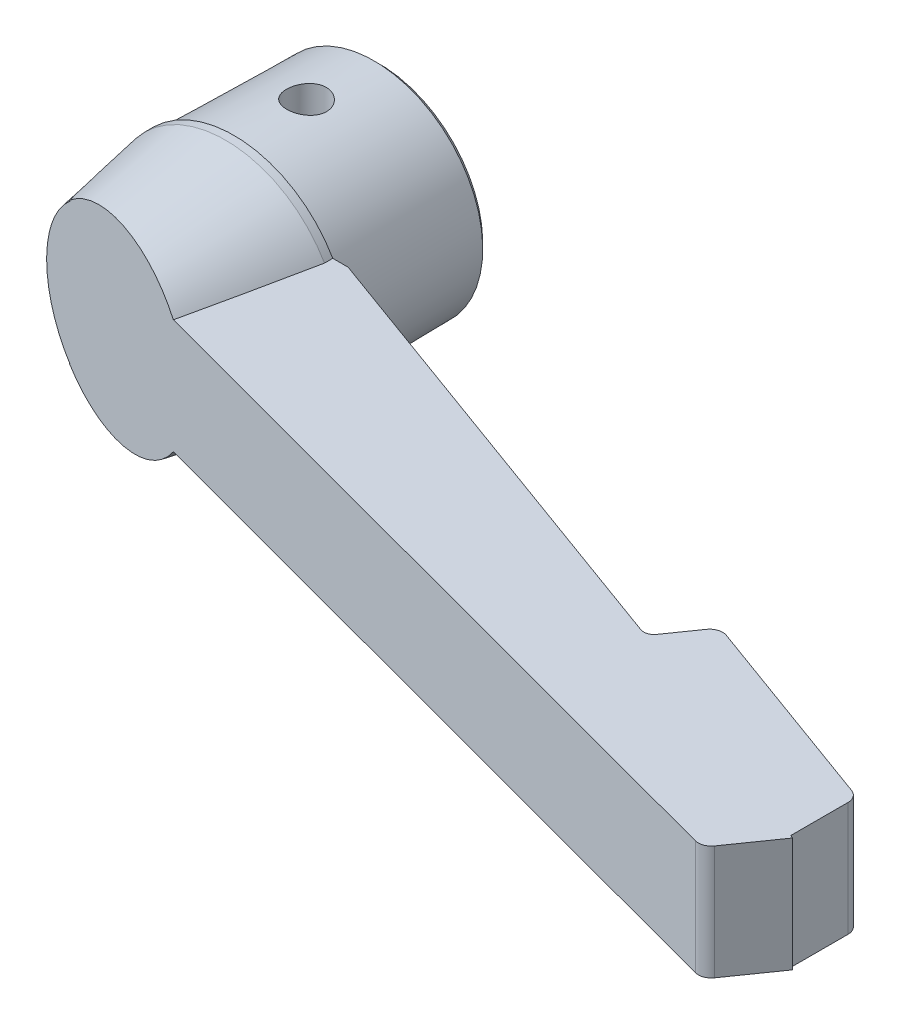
ISO-10303-21;
HEADER;
FILE_DESCRIPTION(('STEP AP214'),'2;1');
FILE_NAME('part.step','',(''),(''),'','','');
FILE_SCHEMA(('AUTOMOTIVE_DESIGN { 1 0 10303 214 1 1 1 1 }'));
ENDSEC;
DATA;
#1=APPLICATION_CONTEXT('core data for automotive mechanical design processes');
#2=APPLICATION_PROTOCOL_DEFINITION('international standard','automotive_design',2000,#1);
#3=PRODUCT_CONTEXT('',#1,'mechanical');
#4=PRODUCT('Part','Part','',(#3));
#5=PRODUCT_RELATED_PRODUCT_CATEGORY('part','',(#4));
#6=PRODUCT_DEFINITION_FORMATION('','',#4);
#7=PRODUCT_DEFINITION_CONTEXT('part definition',#1,'design');
#8=PRODUCT_DEFINITION('design','',#6,#7);
#9=PRODUCT_DEFINITION_SHAPE('','',#8);
#10=(LENGTH_UNIT() NAMED_UNIT(*) SI_UNIT(.MILLI.,.METRE.));
#11=(NAMED_UNIT(*) PLANE_ANGLE_UNIT() SI_UNIT($,.RADIAN.));
#12=(NAMED_UNIT(*) SI_UNIT($,.STERADIAN.) SOLID_ANGLE_UNIT());
#13=UNCERTAINTY_MEASURE_WITH_UNIT(LENGTH_MEASURE(1.E-05),#10,'distance_accuracy_value','');
#14=(GEOMETRIC_REPRESENTATION_CONTEXT(3) GLOBAL_UNCERTAINTY_ASSIGNED_CONTEXT((#13)) GLOBAL_UNIT_ASSIGNED_CONTEXT((#10,
#11,#12)) REPRESENTATION_CONTEXT('',''));
#15=CARTESIAN_POINT('',(0.,0.,0.));
#16=DIRECTION('',(0.,0.,1.));
#17=DIRECTION('',(1.,0.,0.));
#18=AXIS2_PLACEMENT_3D('',#15,#16,#17);
#19=CARTESIAN_POINT('',(0.,0.,14.799999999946));
#20=DIRECTION('',(0.,0.,-1.));
#21=DIRECTION('',(0.,1.,0.));
#22=AXIS2_PLACEMENT_3D('',#19,#20,#21);
#23=CONICAL_SURFACE('',#22,11.,0.17453292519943);
#24=CARTESIAN_POINT('',(-0.434735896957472,0.,24.8212738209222));
#25=DIRECTION('',(-0.257993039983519,0.,0.96614677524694));
#26=DIRECTION('',(-0.96614677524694,0.,-0.257993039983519));
#27=AXIS2_PLACEMENT_3D('',#24,#25,#26);
#28=ELLIPSE('',#27,9.55649729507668,9.22273857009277);
#29=CARTESIAN_POINT('',(-6.68673848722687,-6.78660649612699,23.1517830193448));
#30=VERTEX_POINT('',#29);
#31=CARTESIAN_POINT('',(6.97678813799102,-5.5,26.8003950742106));
#32=VERTEX_POINT('',#31);
#33=EDGE_CURVE('E169',#30,#32,#28,.T.);
#34=ORIENTED_EDGE('',*,*,#33,.F.);
#35=CARTESIAN_POINT('',(-12.0698431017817,-6.78660649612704,-1.34608430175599));
#36=CARTESIAN_POINT('',(-11.919086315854,-6.78660649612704,-0.600847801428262));
#37=CARTESIAN_POINT('',(-11.7676850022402,-6.78660649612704,0.14425839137));
#38=CARTESIAN_POINT('',(-11.4634194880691,-6.78660649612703,1.63417292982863));
#39=CARTESIAN_POINT('',(-11.3105552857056,-6.78660649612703,2.37898127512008));
#40=CARTESIAN_POINT('',(-10.8495423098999,-6.78660649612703,4.61273545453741));
#41=CARTESIAN_POINT('',(-10.5389397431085,-6.78660649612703,6.10117605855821));
#42=CARTESIAN_POINT('',(-9.90959675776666,-6.78660649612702,9.07491641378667));
#43=CARTESIAN_POINT('',(-9.59086406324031,-6.78660649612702,10.5602177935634));
#44=CARTESIAN_POINT('',(-9.10429713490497,-6.78660649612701,12.7864166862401));
#45=CARTESIAN_POINT('',(-8.94068629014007,-6.78660649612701,13.5282373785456));
#46=CARTESIAN_POINT('',(-8.61014283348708,-6.78660649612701,15.011137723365));
#47=CARTESIAN_POINT('',(-8.44321022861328,-6.78660649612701,15.7522173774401));
#48=CARTESIAN_POINT('',(-8.10517675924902,-6.78660649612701,17.234489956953));
#49=CARTESIAN_POINT('',(-7.93407052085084,-6.786606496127,17.975681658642));
#50=CARTESIAN_POINT('',(-7.58710275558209,-6.786606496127,19.4569402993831));
#51=CARTESIAN_POINT('',(-7.41124130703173,-6.786606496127,20.1970072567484));
#52=CARTESIAN_POINT('',(-7.05374079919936,-6.786606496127,21.6755147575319));
#53=CARTESIAN_POINT('',(-6.87210347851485,-6.78660649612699,22.4139557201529));
#54=CARTESIAN_POINT('',(-6.50151382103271,-6.78660649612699,23.8890517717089));
#55=CARTESIAN_POINT('',(-6.31256104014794,-6.78660649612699,24.6257067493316));
#56=CARTESIAN_POINT('',(-5.92504078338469,-6.78660649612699,26.0974309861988));
#57=CARTESIAN_POINT('',(-5.72646223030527,-6.78660649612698,26.8324973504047));
#58=CARTESIAN_POINT('',(-5.41914419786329,-6.78660649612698,27.9323912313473));
#59=CARTESIAN_POINT('',(-5.31513871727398,-6.78660649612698,28.2985417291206));
#60=CARTESIAN_POINT('',(-5.10338648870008,-6.78660649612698,29.029770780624));
#61=CARTESIAN_POINT('',(-4.99563965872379,-6.78660649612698,29.3948493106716));
#62=CARTESIAN_POINT('',(-4.77557033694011,-6.78660649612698,30.1240393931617));
#63=CARTESIAN_POINT('',(-4.66324324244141,-6.78660649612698,30.4881495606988));
#64=CARTESIAN_POINT('',(-4.43314897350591,-6.78660649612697,31.2146267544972));
#65=CARTESIAN_POINT('',(-4.31538213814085,-6.78660649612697,31.5769938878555));
#66=CARTESIAN_POINT('',(-4.07300150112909,-6.78660649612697,32.2996727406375));
#67=CARTESIAN_POINT('',(-3.94838392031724,-6.78660649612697,32.6599832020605));
#68=CARTESIAN_POINT('',(-3.75490317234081,-6.78660649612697,33.1981355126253));
#69=CARTESIAN_POINT('',(-3.68930987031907,-6.78660649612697,33.377152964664));
#70=CARTESIAN_POINT('',(-3.55558594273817,-6.78660649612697,33.7342475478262));
#71=CARTESIAN_POINT('',(-3.48745518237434,-6.78660649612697,33.912324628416));
#72=CARTESIAN_POINT('',(-3.41788106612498,-6.78660649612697,34.0898439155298));
#73=B_SPLINE_CURVE_WITH_KNOTS('',3,(#35,#36,#37,#38,#39,#40,#41,#42,#43,#44,#45,#46,#47,#48,#49,
#50,#51,#52,#53,#54,#55,#56,#57,#58,#59,#60,#61,#62,#63,#64,#65,#66,#67,#68,#69,#70,#71,#72),
.UNSPECIFIED.,.F.,.F.,(4,2,2,2,2,2,2,2,2,2,2,2,2,2,2,2,2,2,4),(0.,2.28099626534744,
4.56199534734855,9.12348661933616,13.6807947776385,15.959735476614,18.2386713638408,
20.52071509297,22.8027212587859,25.0840469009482,27.3655112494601,29.6496664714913,
30.7915572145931,31.9334729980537,33.0765660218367,34.2195878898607,35.3632467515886,
35.9351978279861,36.5071793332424),.UNSPECIFIED.);
#74=CARTESIAN_POINT('',(-8.65690315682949,-6.786606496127,14.799999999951));
#75=VERTEX_POINT('',#74);
#76=EDGE_CURVE('E178',#75,#30,#73,.T.);
#77=ORIENTED_EDGE('',*,*,#76,.F.);
#78=CARTESIAN_POINT('',(0.,0.,14.799999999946));
#79=DIRECTION('',(0.,0.,1.));
#80=DIRECTION('',(0.,-1.,0.));
#81=AXIS2_PLACEMENT_3D('',#78,#79,#80);
#82=CIRCLE('',#81,11.);
#83=CARTESIAN_POINT('',(9.52627944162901,-5.5,14.799999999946));
#84=VERTEX_POINT('',#83);
#85=EDGE_CURVE('E211',#75,#84,#82,.T.);
#86=ORIENTED_EDGE('',*,*,#85,.T.);
#87=CARTESIAN_POINT('',(12.328424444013,-5.5,0.623885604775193));
#88=CARTESIAN_POINT('',(12.0480432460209,-5.5,2.07580611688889));
#89=CARTESIAN_POINT('',(11.766218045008,-5.5,3.52745022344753));
#90=CARTESIAN_POINT('',(11.1987674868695,-5.5,6.42998409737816));
#91=CARTESIAN_POINT('',(10.9131421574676,-5.5,7.88087387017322));
#92=CARTESIAN_POINT('',(10.3363946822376,-5.5,10.7856494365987));
#93=CARTESIAN_POINT('',(10.0452597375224,-5.5,12.2395326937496));
#94=CARTESIAN_POINT('',(9.45685634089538,-5.5,15.1460798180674));
#95=CARTESIAN_POINT('',(9.15958780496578,-5.5,16.5987436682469));
#96=CARTESIAN_POINT('',(8.55699087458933,-5.5,19.5021982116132));
#97=CARTESIAN_POINT('',(8.25166359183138,-5.5,20.9529891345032));
#98=CARTESIAN_POINT('',(7.78526717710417,-5.5,23.1273459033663));
#99=CARTESIAN_POINT('',(7.62840363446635,-5.5,23.8518137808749));
#100=CARTESIAN_POINT('',(7.31129954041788,-5.5,25.3000105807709));
#101=CARTESIAN_POINT('',(7.15105899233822,-5.5,26.0237395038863));
#102=CARTESIAN_POINT('',(6.8268019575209,-5.5,27.4688562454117));
#103=CARTESIAN_POINT('',(6.66279352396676,-5.5,28.190245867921));
#104=CARTESIAN_POINT('',(6.32973241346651,-5.5,29.631859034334));
#105=CARTESIAN_POINT('',(6.16067976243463,-5.5,30.3520825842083));
#106=CARTESIAN_POINT('',(5.81615298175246,-5.5,31.7911486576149));
#107=CARTESIAN_POINT('',(5.64067756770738,-5.5,32.5099908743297));
#108=CARTESIAN_POINT('',(5.28142326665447,-5.5,33.9456051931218));
#109=CARTESIAN_POINT('',(5.0976444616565,-5.5,34.6623773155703));
#110=CARTESIAN_POINT('',(4.81324608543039,-5.5,35.7362388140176));
#111=CARTESIAN_POINT('',(4.7168584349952,-5.5,36.0944490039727));
#112=CARTESIAN_POINT('',(4.5206871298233,-5.5,36.8099286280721));
#113=CARTESIAN_POINT('',(4.42090358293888,-5.5,37.1671980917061));
#114=CARTESIAN_POINT('',(4.21729931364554,-5.5,37.8803553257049));
#115=CARTESIAN_POINT('',(4.11348105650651,-5.5,38.2362437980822));
#116=CARTESIAN_POINT('',(3.90078934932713,-5.5,38.9465544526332));
#117=CARTESIAN_POINT('',(3.79191536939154,-5.5,39.3009764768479));
#118=CARTESIAN_POINT('',(3.56751168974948,-5.5,40.0086782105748));
#119=CARTESIAN_POINT('',(3.45196621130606,-5.5,40.3619529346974));
#120=CARTESIAN_POINT('',(3.21254819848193,-5.5,41.0655917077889));
#121=CARTESIAN_POINT('',(3.08867803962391,-5.5,41.4159565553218));
#122=CARTESIAN_POINT('',(2.89413979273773,-5.5,41.9386440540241));
#123=CARTESIAN_POINT('',(2.8277691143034,-5.5,42.1125650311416));
#124=CARTESIAN_POINT('',(2.69154991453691,-5.5,42.4590236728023));
#125=CARTESIAN_POINT('',(2.62170174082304,-5.5,42.6315614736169));
#126=CARTESIAN_POINT('',(2.47771744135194,-5.5,42.9750475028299));
#127=CARTESIAN_POINT('',(2.40357730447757,-5.5,43.145994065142));
#128=CARTESIAN_POINT('',(2.24987262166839,-5.5,43.4854936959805));
#129=CARTESIAN_POINT('',(2.17030622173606,-5.5,43.6540459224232));
#130=CARTESIAN_POINT('',(2.0874531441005,-5.5,43.8210231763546));
#131=B_SPLINE_CURVE_WITH_KNOTS('',3,(#87,#88,#89,#90,#91,#92,#93,#94,#95,#96,#97,#98,#99,#100,
#101,#102,#103,#104,#105,#106,#107,#108,#109,#110,#111,#112,#113,#114,#115,#116,#117,#118,#119,
#120,#121,#122,#123,#124,#125,#126,#127,#128,#129,#130),.UNSPECIFIED.,.F.,.F.,(4,2,2,2,2,2,2,2,
2,2,2,2,2,2,2,2,2,2,2,2,2,4),(0.,4.43623783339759,8.87244332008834,13.3206711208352,
17.768959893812,22.2166382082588,24.4403988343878,26.6641572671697,28.8835385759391,
31.1029084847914,33.3227246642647,35.5425189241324,36.655360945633,37.7681676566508,
38.8803047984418,39.9925587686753,41.1075606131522,42.2222456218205,42.7806798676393,
43.3390584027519,43.8979674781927,44.4570684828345),.UNSPECIFIED.);
#132=EDGE_CURVE('E233',#84,#32,#131,.T.);
#133=ORIENTED_EDGE('',*,*,#132,.T.);
#134=EDGE_LOOP('',(#34,#77,#86,#133));
#135=FACE_BOUND('',#134,.T.);
#136=ADVANCED_FACE('F14',(#135),#23,.T.);
#137=CARTESIAN_POINT('',(-0.434735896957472,0.,24.8212738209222));
#138=DIRECTION('',(-0.257993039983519,0.,0.96614677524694));
#139=DIRECTION('',(-0.96614677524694,0.,-0.257993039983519));
#140=AXIS2_PLACEMENT_3D('',#137,#138,#139);
#141=ELLIPSE('',#140,9.55649729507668,9.22273857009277);
#142=CARTESIAN_POINT('',(6.97678813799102,5.5,26.8003950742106));
#143=VERTEX_POINT('',#142);
#144=CARTESIAN_POINT('',(-6.68673848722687,6.78660649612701,23.1517830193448));
#145=VERTEX_POINT('',#144);
#146=EDGE_CURVE('E342',#143,#145,#141,.T.);
#147=ORIENTED_EDGE('',*,*,#146,.F.);
#148=CARTESIAN_POINT('',(12.328424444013,5.5,0.623885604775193));
#149=CARTESIAN_POINT('',(12.0480432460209,5.5,2.07580611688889));
#150=CARTESIAN_POINT('',(11.766218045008,5.5,3.52745022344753));
#151=CARTESIAN_POINT('',(11.1987674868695,5.5,6.42998409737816));
#152=CARTESIAN_POINT('',(10.9131421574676,5.5,7.88087387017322));
#153=CARTESIAN_POINT('',(10.3363946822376,5.5,10.7856494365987));
#154=CARTESIAN_POINT('',(10.0452597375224,5.5,12.2395326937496));
#155=CARTESIAN_POINT('',(9.45685634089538,5.5,15.1460798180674));
#156=CARTESIAN_POINT('',(9.15958780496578,5.5,16.5987436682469));
#157=CARTESIAN_POINT('',(8.55699087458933,5.5,19.5021982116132));
#158=CARTESIAN_POINT('',(8.25166359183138,5.5,20.9529891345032));
#159=CARTESIAN_POINT('',(7.78526717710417,5.5,23.1273459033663));
#160=CARTESIAN_POINT('',(7.62840363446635,5.5,23.8518137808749));
#161=CARTESIAN_POINT('',(7.31129954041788,5.5,25.3000105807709));
#162=CARTESIAN_POINT('',(7.15105899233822,5.5,26.0237395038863));
#163=CARTESIAN_POINT('',(6.8268019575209,5.5,27.4688562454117));
#164=CARTESIAN_POINT('',(6.66279352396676,5.5,28.190245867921));
#165=CARTESIAN_POINT('',(6.32973241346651,5.5,29.631859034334));
#166=CARTESIAN_POINT('',(6.16067976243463,5.5,30.3520825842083));
#167=CARTESIAN_POINT('',(5.81615298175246,5.5,31.7911486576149));
#168=CARTESIAN_POINT('',(5.64067756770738,5.5,32.5099908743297));
#169=CARTESIAN_POINT('',(5.28142326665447,5.5,33.9456051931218));
#170=CARTESIAN_POINT('',(5.0976444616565,5.5,34.6623773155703));
#171=CARTESIAN_POINT('',(4.81324608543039,5.5,35.7362388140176));
#172=CARTESIAN_POINT('',(4.7168584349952,5.5,36.0944490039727));
#173=CARTESIAN_POINT('',(4.5206871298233,5.5,36.8099286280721));
#174=CARTESIAN_POINT('',(4.42090358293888,5.5,37.1671980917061));
#175=CARTESIAN_POINT('',(4.21729931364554,5.5,37.8803553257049));
#176=CARTESIAN_POINT('',(4.11348105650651,5.5,38.2362437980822));
#177=CARTESIAN_POINT('',(3.90078934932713,5.5,38.9465544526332));
#178=CARTESIAN_POINT('',(3.79191536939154,5.5,39.3009764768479));
#179=CARTESIAN_POINT('',(3.56751168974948,5.5,40.0086782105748));
#180=CARTESIAN_POINT('',(3.45196621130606,5.5,40.3619529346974));
#181=CARTESIAN_POINT('',(3.21254819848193,5.5,41.0655917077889));
#182=CARTESIAN_POINT('',(3.08867803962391,5.5,41.4159565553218));
#183=CARTESIAN_POINT('',(2.89413979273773,5.5,41.9386440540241));
#184=CARTESIAN_POINT('',(2.8277691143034,5.5,42.1125650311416));
#185=CARTESIAN_POINT('',(2.69154991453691,5.5,42.4590236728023));
#186=CARTESIAN_POINT('',(2.62170174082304,5.5,42.6315614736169));
#187=CARTESIAN_POINT('',(2.47771744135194,5.5,42.9750475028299));
#188=CARTESIAN_POINT('',(2.40357730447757,5.5,43.145994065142));
#189=CARTESIAN_POINT('',(2.24987262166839,5.5,43.4854936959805));
#190=CARTESIAN_POINT('',(2.17030622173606,5.5,43.6540459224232));
#191=CARTESIAN_POINT('',(2.0874531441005,5.5,43.8210231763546));
#192=B_SPLINE_CURVE_WITH_KNOTS('',3,(#148,#149,#150,#151,#152,#153,#154,#155,#156,#157,#158,
#159,#160,#161,#162,#163,#164,#165,#166,#167,#168,#169,#170,#171,#172,#173,#174,#175,#176,#177,
#178,#179,#180,#181,#182,#183,#184,#185,#186,#187,#188,#189,#190,#191),.UNSPECIFIED.,.F.,.F.,(4,
2,2,2,2,2,2,2,2,2,2,2,2,2,2,2,2,2,2,2,2,4),(0.,4.43623783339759,8.87244332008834,
13.3206711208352,17.768959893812,22.2166382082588,24.4403988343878,26.6641572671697,
28.8835385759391,31.1029084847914,33.3227246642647,35.5425189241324,36.655360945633,
37.7681676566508,38.8803047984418,39.9925587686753,41.1075606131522,42.2222456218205,
42.7806798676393,43.3390584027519,43.8979674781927,44.4570684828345),.UNSPECIFIED.);
#193=CARTESIAN_POINT('',(9.52627944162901,5.5,14.799999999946));
#194=VERTEX_POINT('',#193);
#195=EDGE_CURVE('E445',#194,#143,#192,.T.);
#196=ORIENTED_EDGE('',*,*,#195,.F.);
#197=CARTESIAN_POINT('',(-8.65690315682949,6.78660649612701,14.7999999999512));
#198=VERTEX_POINT('',#197);
#199=EDGE_CURVE('E28',#194,#198,#82,.T.);
#200=ORIENTED_EDGE('',*,*,#199,.T.);
#201=CARTESIAN_POINT('',(-3.41788106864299,6.786606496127,34.0898439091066));
#202=CARTESIAN_POINT('',(-3.51688686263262,6.786606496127,33.8371165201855));
#203=CARTESIAN_POINT('',(-3.61302520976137,6.786606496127,33.5832888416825));
#204=CARTESIAN_POINT('',(-3.80044496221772,6.786606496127,33.073875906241));
#205=CARTESIAN_POINT('',(-3.89172691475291,6.786606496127,32.8182908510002));
#206=CARTESIAN_POINT('',(-4.07030162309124,6.786606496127,32.3058412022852));
#207=CARTESIAN_POINT('',(-4.15759580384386,6.786606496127,32.0489771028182));
#208=CARTESIAN_POINT('',(-4.32883588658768,6.786606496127,31.5341283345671));
#209=CARTESIAN_POINT('',(-4.41278167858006,6.786606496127,31.276143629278));
#210=CARTESIAN_POINT('',(-4.66022340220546,6.78660649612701,30.501238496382));
#211=CARTESIAN_POINT('',(-4.8194639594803,6.78660649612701,29.9829589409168));
#212=CARTESIAN_POINT('',(-5.12939275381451,6.78660649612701,28.9438088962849));
#213=CARTESIAN_POINT('',(-5.28008006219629,6.78660649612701,28.4229381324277));
#214=CARTESIAN_POINT('',(-5.57454714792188,6.78660649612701,27.3799105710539));
#215=CARTESIAN_POINT('',(-5.71833479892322,6.78660649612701,26.8577559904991));
#216=CARTESIAN_POINT('',(-6.0004912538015,6.78660649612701,25.8120109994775));
#217=CARTESIAN_POINT('',(-6.13886026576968,6.78660649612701,25.2884206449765));
#218=CARTESIAN_POINT('',(-6.41116817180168,6.78660649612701,24.2399837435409));
#219=CARTESIAN_POINT('',(-6.54510620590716,6.78660649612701,23.7151369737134));
#220=CARTESIAN_POINT('',(-6.8092515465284,6.78660649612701,22.6645029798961));
#221=CARTESIAN_POINT('',(-6.93945882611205,6.78660649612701,22.1387157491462));
#222=CARTESIAN_POINT('',(-7.17215642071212,6.78660649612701,21.186785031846));
#223=CARTESIAN_POINT('',(-7.27519401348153,6.78660649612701,20.7607750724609));
#224=CARTESIAN_POINT('',(-7.47942833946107,6.78660649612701,19.9083382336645));
#225=CARTESIAN_POINT('',(-7.58062517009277,6.78660649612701,19.4819113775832));
#226=CARTESIAN_POINT('',(-7.78140977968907,6.78660649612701,18.6285761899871));
#227=CARTESIAN_POINT('',(-7.88099718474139,6.78660649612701,18.2016677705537));
#228=CARTESIAN_POINT('',(-8.0787114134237,6.78660649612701,17.3475057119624));
#229=CARTESIAN_POINT('',(-8.17683821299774,6.78660649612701,16.9202520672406));
#230=CARTESIAN_POINT('',(-8.44334198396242,6.78660649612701,15.7516453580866));
#231=CARTESIAN_POINT('',(-8.61040136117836,6.78660649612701,15.0099916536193));
#232=CARTESIAN_POINT('',(-8.9411947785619,6.78660649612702,13.5259424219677));
#233=CARTESIAN_POINT('',(-9.1049288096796,6.78660649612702,12.7835468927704));
#234=CARTESIAN_POINT('',(-9.59190283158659,6.78660649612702,10.5554240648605));
#235=CARTESIAN_POINT('',(-9.91091217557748,6.78660649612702,9.06877189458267));
#236=CARTESIAN_POINT('',(-10.5402703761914,6.78660649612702,6.0948175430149));
#237=CARTESIAN_POINT('',(-10.8506256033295,6.78660649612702,4.60751670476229));
#238=CARTESIAN_POINT('',(-11.3112536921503,6.78660649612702,2.37558219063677));
#239=CARTESIAN_POINT('',(-11.4639763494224,6.78660649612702,1.63145292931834));
#240=CARTESIAN_POINT('',(-11.7679614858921,6.78660649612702,0.142897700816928));
#241=CARTESIAN_POINT('',(-11.9192239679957,6.78660649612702,-0.601528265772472));
#242=CARTESIAN_POINT('',(-12.0698431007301,6.78660649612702,-1.34608429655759));
#243=B_SPLINE_CURVE_WITH_KNOTS('',3,(#201,#202,#203,#204,#205,#206,#207,#208,#209,#210,#211,
#212,#213,#214,#215,#216,#217,#218,#219,#220,#221,#222,#223,#224,#225,#226,#227,#228,#229,#230,
#231,#232,#233,#234,#235,#236,#237,#238,#239,#240,#241,#242),.UNSPECIFIED.,.F.,.F.,(4,2,2,2,2,2,
2,2,2,2,2,2,2,2,2,2,2,2,2,2,4),(0.,0.814236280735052,1.628380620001,2.4422317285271,
3.25610955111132,4.88257087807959,6.50920846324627,8.13394334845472,9.75861577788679,
11.3836016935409,13.0085993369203,14.3234757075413,15.638282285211,16.9533900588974,
18.2685194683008,20.5492178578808,22.8299224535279,27.391366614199,31.9493592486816,
34.2282773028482,36.5071908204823),.UNSPECIFIED.);
#244=EDGE_CURVE('E167',#145,#198,#243,.T.);
#245=ORIENTED_EDGE('',*,*,#244,.F.);
#246=EDGE_LOOP('',(#147,#196,#200,#245));
#247=FACE_BOUND('',#246,.T.);
#248=ADVANCED_FACE('F331',(#247),#23,.T.);
#249=CARTESIAN_POINT('',(-12.9285598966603,-6.78660649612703,21.0433918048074));
#250=DIRECTION('',(0.,1.,0.));
#251=DIRECTION('',(-1.,0.,0.));
#252=AXIS2_PLACEMENT_3D('',#249,#250,#251);
#253=PLANE('',#252);
#254=ORIENTED_EDGE('',*,*,#76,.T.);
#255=DIRECTION('',(0.96614677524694,0.,0.257993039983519));
#256=VECTOR('',#255,1.);
#257=CARTESIAN_POINT('',(-13.0386375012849,-6.78660649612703,21.4556165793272));
#258=LINE('',#257,#256);
#259=CARTESIAN_POINT('',(-6.60651391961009,-6.786606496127,23.1732056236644));
#260=VERTEX_POINT('',#259);
#261=EDGE_CURVE('E345',#30,#260,#258,.T.);
#262=ORIENTED_EDGE('',*,*,#261,.T.);
#263=DIRECTION('',(-0.237847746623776,0.,-0.971302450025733));
#264=VECTOR('',#263,1.);
#265=CARTESIAN_POINT('',(-7.12805220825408,-6.786606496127,21.0433918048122));
#266=LINE('',#265,#264);
#267=EDGE_CURVE('E160',#260,#75,#266,.T.);
#268=ORIENTED_EDGE('',*,*,#267,.T.);
#269=EDGE_LOOP('',(#254,#262,#268));
#270=FACE_BOUND('',#269,.T.);
#271=ADVANCED_FACE('F190',(#270),#253,.T.);
#272=CARTESIAN_POINT('',(-7.12805220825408,6.78660649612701,21.0433918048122));
#273=DIRECTION('',(0.,-1.,0.));
#274=DIRECTION('',(0.,0.,-1.));
#275=AXIS2_PLACEMENT_3D('',#272,#273,#274);
#276=PLANE('',#275);
#277=DIRECTION('',(0.237847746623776,0.,0.971302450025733));
#278=VECTOR('',#277,1.);
#279=CARTESIAN_POINT('',(-7.12805220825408,6.78660649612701,21.0433918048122));
#280=LINE('',#279,#278);
#281=CARTESIAN_POINT('',(-6.60651391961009,6.78660649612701,23.1732056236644));
#282=VERTEX_POINT('',#281);
#283=EDGE_CURVE('E165',#198,#282,#280,.T.);
#284=ORIENTED_EDGE('',*,*,#283,.T.);
#285=DIRECTION('',(-0.966146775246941,0.,-0.257993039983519));
#286=VECTOR('',#285,1.);
#287=CARTESIAN_POINT('',(-7.62421397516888,6.78660649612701,22.901446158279));
#288=LINE('',#287,#286);
#289=EDGE_CURVE('E34',#282,#145,#288,.T.);
#290=ORIENTED_EDGE('',*,*,#289,.T.);
#291=ORIENTED_EDGE('',*,*,#244,.T.);
#292=EDGE_LOOP('',(#284,#290,#291));
#293=FACE_BOUND('',#292,.T.);
#294=ADVANCED_FACE('F185',(#293),#276,.T.);
#295=CARTESIAN_POINT('',(-8.79824314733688,0.,27.2867836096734));
#296=CARTESIAN_POINT('',(-9.04288279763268,0.,25.8993632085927));
#297=CARTESIAN_POINT('',(-9.53216209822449,0.,23.124522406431));
#298=CARTESIAN_POINT('',(-10.2660810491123,0.,18.9622612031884));
#299=CARTESIAN_POINT('',(-10.7553603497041,0.,16.1874204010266));
#300=CARTESIAN_POINT('',(-11.,0.,14.799999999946));
#301=CARTESIAN_POINT('',(-8.79824314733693,-0.00260530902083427,27.2867836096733));
#302=CARTESIAN_POINT('',(-9.04288279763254,-0.00259324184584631,25.8993632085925));
#303=CARTESIAN_POINT('',(-9.53216209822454,-0.00256886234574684,23.1245224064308));
#304=CARTESIAN_POINT('',(-10.2660810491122,-0.00253144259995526,18.9622612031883));
#305=CARTESIAN_POINT('',(-10.755360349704,-0.00250592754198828,16.1874204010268));
#306=CARTESIAN_POINT('',(-10.9999999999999,-0.002493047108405,14.7999999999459));
#307=CARTESIAN_POINT('',(-8.79823735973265,-0.0156357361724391,27.2867836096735));
#308=CARTESIAN_POINT('',(-9.04288639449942,-0.015563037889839,25.8993109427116));
#309=CARTESIAN_POINT('',(-9.53217524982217,-0.015416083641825,23.1244178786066));
#310=CARTESIAN_POINT('',(-10.2660947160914,-0.0151909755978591,18.9621566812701));
#311=CARTESIAN_POINT('',(-10.755365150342,-0.0150377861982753,16.1873681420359));
#312=CARTESIAN_POINT('',(-10.9999957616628,-0.0149604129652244,14.7999999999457));
#313=CARTESIAN_POINT('',(-8.79795880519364,-0.120137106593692,27.2867836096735));
#314=CARTESIAN_POINT('',(-9.04267727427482,-0.119565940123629,25.8989633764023));
#315=CARTESIAN_POINT('',(-9.53204378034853,-0.118412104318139,23.1237229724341));
#316=CARTESIAN_POINT('',(-10.2659881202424,-0.116646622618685,18.9614621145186));
#317=CARTESIAN_POINT('',(-10.7552141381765,-0.115446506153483,16.1870209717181));
#318=CARTESIAN_POINT('',(-10.9997920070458,-0.114840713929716,14.7999999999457));
#319=CARTESIAN_POINT('',(-8.79089813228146,-0.47273491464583,27.2867836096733));
#320=CARTESIAN_POINT('',(-9.03602510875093,-0.470357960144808,25.8978346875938));
#321=CARTESIAN_POINT('',(-9.52601121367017,-0.46556554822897,23.1214687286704));
#322=CARTESIAN_POINT('',(-10.2605932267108,-0.458257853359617,18.959212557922));
#323=CARTESIAN_POINT('',(-10.7500508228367,-0.453306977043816,16.1858977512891));
#324=CARTESIAN_POINT('',(-10.9946467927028,-0.450812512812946,14.7999999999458));
#325=CARTESIAN_POINT('',(-8.58405852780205,-3.1085748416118,27.2867836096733));
#326=CARTESIAN_POINT('',(-8.83716953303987,-3.08642265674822,25.8905121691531));
#327=CARTESIAN_POINT('',(-9.34175898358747,-3.04225968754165,23.1069325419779));
#328=CARTESIAN_POINT('',(-10.0962141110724,-2.97622345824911,18.9448370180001));
#329=CARTESIAN_POINT('',(-10.5976001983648,-2.93233508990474,16.1787626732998));
#330=CARTESIAN_POINT('',(-10.8475147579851,-2.91045834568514,14.7999999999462));
#331=CARTESIAN_POINT('',(-7.35294476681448,-5.33970326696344,27.2867836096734));
#332=CARTESIAN_POINT('',(-7.64512476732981,-5.31472283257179,25.8917779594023));
#333=CARTESIAN_POINT('',(-8.22777563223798,-5.26486127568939,23.1094343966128));
#334=CARTESIAN_POINT('',(-9.09906435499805,-5.19016036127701,18.9472952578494));
#335=CARTESIAN_POINT('',(-9.67816542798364,-5.14041955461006,16.1799775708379));
#336=CARTESIAN_POINT('',(-9.96689621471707,-5.11559712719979,14.7999999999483));
#337=CARTESIAN_POINT('',(-5.59920125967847,-6.786606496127,27.2867836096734));
#338=CARTESIAN_POINT('',(-5.93894591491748,-6.786606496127,25.8993632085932));
#339=CARTESIAN_POINT('',(-6.61843522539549,-6.786606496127,23.1245224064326));
#340=CARTESIAN_POINT('',(-7.6376691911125,-6.786606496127,18.962261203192));
#341=CARTESIAN_POINT('',(-8.31715850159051,-6.786606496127,16.1874204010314));
#342=CARTESIAN_POINT('',(-8.65690315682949,-6.786606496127,14.799999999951));
#343=(BOUNDED_SURFACE() B_SPLINE_SURFACE(3,3,((#295,#296,#297,#298,#299,#300),(#301,#302,#303,
#304,#305,#306),(#307,#308,#309,#310,#311,#312),(#313,#314,#315,#316,#317,#318),(#319,#320,#321,
#322,#323,#324),(#325,#326,#327,#328,#329,#330),(#331,#332,#333,#334,#335,#336),(#337,#338,#339,
#340,#341,#342)),.UNSPECIFIED.,.F.,.F.,.F.) B_SPLINE_SURFACE_WITH_KNOTS((4,1,1,1,1,4),(4,1,1,4),
(0.,0.00104166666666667,0.00520833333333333,0.0416666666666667,0.140625,1.),(0.,
0.333333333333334,0.666666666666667,1.),
.UNSPECIFIED.) GEOMETRIC_REPRESENTATION_ITEM() RATIONAL_B_SPLINE_SURFACE(((1.,1.,1.,1.,1.,1.),
(0.999933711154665,0.999936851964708,0.999943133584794,0.999952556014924,0.99995883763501,
0.999961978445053),(0.99960261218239,0.999621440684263,0.99965909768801,0.99971558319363,
0.999753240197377,0.99977206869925),(0.996967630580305,0.997111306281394,0.997398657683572,
0.997829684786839,0.998117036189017,0.998260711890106),(0.988501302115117,0.989046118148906,
0.990135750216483,0.99177019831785,0.992859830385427,0.993404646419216),(0.93673558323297,
0.939733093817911,0.945728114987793,0.954720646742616,0.960715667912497,0.963713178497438),
(0.945311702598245,0.947902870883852,0.953085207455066,0.960858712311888,0.966041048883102,
0.968632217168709),(1.,1.,1.,1.,1.,1.))) REPRESENTATION_ITEM('') SURFACE());
#344=CARTESIAN_POINT('',(-9.66771494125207,0.,22.355764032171));
#345=CARTESIAN_POINT('',(-9.66771397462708,-0.167695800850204,22.3557642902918));
#346=CARTESIAN_POINT('',(-9.66305234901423,-0.335346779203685,22.3570090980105));
#347=CARTESIAN_POINT('',(-9.64443290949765,-0.670058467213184,22.3619811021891));
#348=CARTESIAN_POINT('',(-9.63047710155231,-0.837119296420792,22.3657077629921));
#349=CARTESIAN_POINT('',(-9.57470753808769,-1.33673446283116,22.3806000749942));
#350=CARTESIAN_POINT('',(-9.51899163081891,-1.66776209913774,22.3954780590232));
#351=CARTESIAN_POINT('',(-9.39053770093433,-2.2363047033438,22.4297794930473));
#352=CARTESIAN_POINT('',(-9.32593588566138,-2.47585076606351,22.4470303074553));
#353=CARTESIAN_POINT('',(-9.17741146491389,-2.94854230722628,22.4866912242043));
#354=CARTESIAN_POINT('',(-9.09348398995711,-3.18168615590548,22.5091026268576));
#355=CARTESIAN_POINT('',(-8.90692982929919,-3.6400922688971,22.5589187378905));
#356=CARTESIAN_POINT('',(-8.80428332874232,-3.86534587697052,22.5863287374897));
#357=CARTESIAN_POINT('',(-8.58119793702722,-4.30620673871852,22.6458998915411));
#358=CARTESIAN_POINT('',(-8.46075936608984,-4.52181416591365,22.6780609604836));
#359=CARTESIAN_POINT('',(-8.21393530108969,-4.92425303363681,22.7439711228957));
#360=CARTESIAN_POINT('',(-8.08890632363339,-5.11197828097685,22.7773579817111));
#361=CARTESIAN_POINT('',(-7.82557391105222,-5.4771741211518,22.8476764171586));
#362=CARTESIAN_POINT('',(-7.68727059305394,-5.65464480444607,22.8846079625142));
#363=CARTESIAN_POINT('',(-7.3984535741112,-5.99821129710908,22.9617316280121));
#364=CARTESIAN_POINT('',(-7.24795500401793,-6.16432074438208,23.0019197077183));
#365=CARTESIAN_POINT('',(-6.93555330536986,-6.48460667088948,23.0853412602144));
#366=CARTESIAN_POINT('',(-6.77365081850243,-6.63878382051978,23.1285745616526));
#367=CARTESIAN_POINT('',(-6.60651391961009,-6.786606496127,23.1732056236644));
#368=B_SPLINE_CURVE_WITH_KNOTS('',3,(#344,#345,#346,#347,#348,#349,#350,#351,#352,#353,#354,
#355,#356,#357,#358,#359,#360,#361,#362,#363,#364,#365,#366,#367),.UNSPECIFIED.,.F.,.F.,(4,2,2,
2,2,2,2,2,2,2,2,4),(0.,0.502928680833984,1.00574885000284,2.0112680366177,2.75657694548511,
3.50207385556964,4.24836453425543,4.99464178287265,5.67802788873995,6.36140796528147,
7.04395277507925,7.72645920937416),.UNSPECIFIED.);
#369=CARTESIAN_POINT('',(-9.66771494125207,0.,22.355764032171));
#370=VERTEX_POINT('',#369);
#371=EDGE_CURVE('E149',#370,#260,#368,.T.);
#372=DIRECTION('',(0.173648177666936,0.,0.984807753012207));
#373=VECTOR('',#372,1.);
#374=CARTESIAN_POINT('',(-9.89912157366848,0.,21.0433918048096));
#375=LINE('',#374,#373);
#376=CARTESIAN_POINT('',(-11.,0.,14.799999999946));
#377=VERTEX_POINT('',#376);
#378=EDGE_CURVE('E158',#377,#370,#375,.T.);
#379=EDGE_CURVE('E42',#377,#75,#82,.T.);
#380=ORIENTED_EDGE('',*,*,#371,.F.);
#381=ORIENTED_EDGE('',*,*,#378,.F.);
#382=ORIENTED_EDGE('',*,*,#379,.T.);
#383=ORIENTED_EDGE('',*,*,#267,.F.);
#384=EDGE_LOOP('',(#380,#381,#382,#383));
#385=FACE_BOUND('',#384,.T.);
#386=ADVANCED_FACE('F157',(#385),#343,.F.);
#387=CARTESIAN_POINT('',(-5.59920125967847,6.78660649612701,27.2867836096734));
#388=CARTESIAN_POINT('',(-5.93894591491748,6.78660649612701,25.8993632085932));
#389=CARTESIAN_POINT('',(-6.61843522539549,6.78660649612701,23.1245224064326));
#390=CARTESIAN_POINT('',(-7.6376691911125,6.78660649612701,18.962261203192));
#391=CARTESIAN_POINT('',(-8.31715850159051,6.78660649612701,16.1874204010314));
#392=CARTESIAN_POINT('',(-8.65690315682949,6.78660649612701,14.799999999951));
#393=CARTESIAN_POINT('',(-7.35294476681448,5.33970326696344,27.2867836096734));
#394=CARTESIAN_POINT('',(-7.64512476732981,5.3147228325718,25.8917779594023));
#395=CARTESIAN_POINT('',(-8.22777563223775,5.26486127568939,23.1094343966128));
#396=CARTESIAN_POINT('',(-9.09906435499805,5.19016036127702,18.9472952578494));
#397=CARTESIAN_POINT('',(-9.67816542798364,5.14041955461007,16.1799775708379));
#398=CARTESIAN_POINT('',(-9.96689621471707,5.1155971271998,14.7999999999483));
#399=CARTESIAN_POINT('',(-8.58405852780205,3.1085748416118,27.2867836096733));
#400=CARTESIAN_POINT('',(-8.83716953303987,3.08642265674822,25.8905121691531));
#401=CARTESIAN_POINT('',(-9.34175898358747,3.04225968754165,23.1069325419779));
#402=CARTESIAN_POINT('',(-10.0962141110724,2.97622345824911,18.9448370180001));
#403=CARTESIAN_POINT('',(-10.5976001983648,2.93233508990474,16.1787626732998));
#404=CARTESIAN_POINT('',(-10.8475147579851,2.91045834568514,14.7999999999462));
#405=CARTESIAN_POINT('',(-8.79089813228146,0.472734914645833,27.2867836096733));
#406=CARTESIAN_POINT('',(-9.03602510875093,0.470357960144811,25.8978346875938));
#407=CARTESIAN_POINT('',(-9.52601121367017,0.465565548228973,23.1214687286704));
#408=CARTESIAN_POINT('',(-10.2605932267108,0.458257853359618,18.959212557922));
#409=CARTESIAN_POINT('',(-10.7500508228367,0.453306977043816,16.1858977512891));
#410=CARTESIAN_POINT('',(-10.9946467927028,0.450812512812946,14.7999999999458));
#411=CARTESIAN_POINT('',(-8.79795880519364,0.120137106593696,27.2867836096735));
#412=CARTESIAN_POINT('',(-9.04267727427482,0.119565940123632,25.8989633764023));
#413=CARTESIAN_POINT('',(-9.53204378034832,0.118412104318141,23.1237229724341));
#414=CARTESIAN_POINT('',(-10.2659881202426,0.116646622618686,18.9614621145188));
#415=CARTESIAN_POINT('',(-10.7552141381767,0.115446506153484,16.1870209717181));
#416=CARTESIAN_POINT('',(-10.9997920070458,0.114840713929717,14.7999999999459));
#417=CARTESIAN_POINT('',(-8.79823735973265,0.0156357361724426,27.2867836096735));
#418=CARTESIAN_POINT('',(-9.04288639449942,0.0155630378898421,25.8993109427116));
#419=CARTESIAN_POINT('',(-9.53217524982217,0.0154160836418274,23.1244178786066));
#420=CARTESIAN_POINT('',(-10.2660947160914,0.0151909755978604,18.9621566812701));
#421=CARTESIAN_POINT('',(-10.755365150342,0.0150377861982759,16.1873681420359));
#422=CARTESIAN_POINT('',(-10.9999957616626,0.0149604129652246,14.7999999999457));
#423=CARTESIAN_POINT('',(-8.79824314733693,0.00260530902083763,27.2867836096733));
#424=CARTESIAN_POINT('',(-9.04288279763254,0.00259324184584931,25.8993632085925));
#425=CARTESIAN_POINT('',(-9.53216209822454,0.00256886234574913,23.1245224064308));
#426=CARTESIAN_POINT('',(-10.2660810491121,0.00253144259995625,18.9622612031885));
#427=CARTESIAN_POINT('',(-10.755360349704,0.0025059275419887,16.1874204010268));
#428=CARTESIAN_POINT('',(-10.9999999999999,0.00249304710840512,14.7999999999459));
#429=CARTESIAN_POINT('',(-8.79824314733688,0.,27.2867836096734));
#430=CARTESIAN_POINT('',(-9.04288279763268,0.,25.8993632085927));
#431=CARTESIAN_POINT('',(-9.53216209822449,0.,23.124522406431));
#432=CARTESIAN_POINT('',(-10.2660810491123,0.,18.9622612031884));
#433=CARTESIAN_POINT('',(-10.7553603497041,0.,16.1874204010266));
#434=CARTESIAN_POINT('',(-11.,0.,14.799999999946));
#435=(BOUNDED_SURFACE() B_SPLINE_SURFACE(3,3,((#387,#388,#389,#390,#391,#392),(#393,#394,#395,
#396,#397,#398),(#399,#400,#401,#402,#403,#404),(#405,#406,#407,#408,#409,#410),(#411,#412,#413,
#414,#415,#416),(#417,#418,#419,#420,#421,#422),(#423,#424,#425,#426,#427,#428),(#429,#430,#431,
#432,#433,#434)),.UNSPECIFIED.,.F.,.F.,.F.) B_SPLINE_SURFACE_WITH_KNOTS((4,1,1,1,1,4),(4,1,1,4),
(0.,0.859375,0.958333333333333,0.994791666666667,0.998958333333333,1.),(0.,0.333333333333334,
0.666666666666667,1.),
.UNSPECIFIED.) GEOMETRIC_REPRESENTATION_ITEM() RATIONAL_B_SPLINE_SURFACE(((1.,1.,1.,1.,1.,1.),
(0.945311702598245,0.947902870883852,0.953085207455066,0.960858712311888,0.966041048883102,
0.968632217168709),(0.93673558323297,0.939733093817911,0.945728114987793,0.954720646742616,
0.960715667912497,0.963713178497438),(0.988501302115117,0.989046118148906,0.990135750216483,
0.99177019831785,0.992859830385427,0.993404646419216),(0.996967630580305,0.997111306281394,
0.997398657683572,0.997829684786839,0.998117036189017,0.998260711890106),(0.99960261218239,
0.999621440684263,0.99965909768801,0.99971558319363,0.999753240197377,0.99977206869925),
(0.999933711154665,0.999936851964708,0.999943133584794,0.999952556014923,0.99995883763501,
0.999961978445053),(1.,1.,1.,1.,1.,1.))) REPRESENTATION_ITEM('') SURFACE());
#436=CARTESIAN_POINT('',(-6.60651391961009,6.78660649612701,23.1732056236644));
#437=CARTESIAN_POINT('',(-6.72943816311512,6.67786844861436,23.1403807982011));
#438=CARTESIAN_POINT('',(-6.84951158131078,6.56573585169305,23.1083172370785));
#439=CARTESIAN_POINT('',(-7.08363736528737,6.33489995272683,23.0457979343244));
#440=CARTESIAN_POINT('',(-7.19768900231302,6.21619585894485,23.0153423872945));
#441=CARTESIAN_POINT('',(-7.53060233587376,5.850249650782,22.9264435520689));
#442=CARTESIAN_POINT('',(-7.73987248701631,5.59348278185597,22.8705615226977));
#443=CARTESIAN_POINT('',(-8.08161240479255,5.12376806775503,22.7793056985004));
#444=CARTESIAN_POINT('',(-8.2203014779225,4.91560882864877,22.7422711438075));
#445=CARTESIAN_POINT('',(-8.48034644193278,4.48787952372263,22.6728305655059));
#446=CARTESIAN_POINT('',(-8.60169801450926,4.26830663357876,22.6404256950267));
#447=CARTESIAN_POINT('',(-8.82597775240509,3.81932133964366,22.580535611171));
#448=CARTESIAN_POINT('',(-8.92890671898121,3.58990936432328,22.5530501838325));
#449=CARTESIAN_POINT('',(-9.11547104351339,3.12283271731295,22.5032313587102));
#450=CARTESIAN_POINT('',(-9.19910774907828,2.88516862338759,22.4808976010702));
#451=CARTESIAN_POINT('',(-9.33792883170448,2.43089302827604,22.4438277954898));
#452=CARTESIAN_POINT('',(-9.39527419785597,2.21498574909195,22.4285146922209));
#453=CARTESIAN_POINT('',(-9.49387488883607,1.77927993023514,22.402185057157));
#454=CARTESIAN_POINT('',(-9.53513146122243,1.55948169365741,22.391168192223));
#455=CARTESIAN_POINT('',(-9.60129004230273,1.11708172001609,22.3735016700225));
#456=CARTESIAN_POINT('',(-9.62617873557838,0.89447785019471,22.3668555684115));
#457=CARTESIAN_POINT('',(-9.6594029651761,0.447917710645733,22.3579836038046));
#458=CARTESIAN_POINT('',(-9.66773601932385,0.223961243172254,22.3557584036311));
#459=CARTESIAN_POINT('',(-9.66771494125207,0.,22.355764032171));
#460=B_SPLINE_CURVE_WITH_KNOTS('',3,(#436,#437,#438,#439,#440,#441,#442,#443,#444,#445,#446,
#447,#448,#449,#450,#451,#452,#453,#454,#455,#456,#457,#458,#459),.UNSPECIFIED.,.F.,.F.,(4,2,2,
2,2,2,2,2,2,2,2,4),(0.,0.501964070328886,1.00398874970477,2.00945938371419,2.76722415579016,
3.5251773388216,4.2830975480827,5.04096479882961,5.71208104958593,6.3831452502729,
7.05475469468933,7.72646482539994),.UNSPECIFIED.);
#461=EDGE_CURVE('E9',#282,#370,#460,.T.);
#462=CARTESIAN_POINT('',(0.,0.,14.7999999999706));
#463=DIRECTION('',(-2.25857265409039E-12,0.,1.));
#464=DIRECTION('',(-1.,0.,-2.25857265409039E-12));
#465=AXIS2_PLACEMENT_3D('',#462,#463,#464);
#466=CIRCLE('',#465,11.);
#467=EDGE_CURVE('E164',#377,#198,#466,.F.);
#468=ORIENTED_EDGE('',*,*,#461,.F.);
#469=ORIENTED_EDGE('',*,*,#283,.F.);
#470=ORIENTED_EDGE('',*,*,#467,.F.);
#471=ORIENTED_EDGE('',*,*,#378,.T.);
#472=EDGE_LOOP('',(#468,#469,#470,#471));
#473=FACE_BOUND('',#472,.T.);
#474=ADVANCED_FACE('F163',(#473),#435,.F.);
#475=CARTESIAN_POINT('',(0.,0.,30.1125597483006));
#476=DIRECTION('',(0.,0.,1.));
#477=DIRECTION('',(0.,-1.,0.));
#478=AXIS2_PLACEMENT_3D('',#475,#476,#477);
#479=CYLINDRICAL_SURFACE('',#478,5.00000000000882);
#480=CARTESIAN_POINT('',(1.9,4.6249324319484,7.));
#481=CARTESIAN_POINT('',(1.90000436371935,4.62492829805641,7.1024961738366));
#482=CARTESIAN_POINT('',(1.89167872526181,4.62837659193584,7.20496406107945));
#483=CARTESIAN_POINT('',(1.85875324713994,4.64169676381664,7.40680388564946));
#484=CARTESIAN_POINT('',(1.83415423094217,4.65156831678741,7.50617597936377));
#485=CARTESIAN_POINT('',(1.76972022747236,4.6764587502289,7.69885053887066));
#486=CARTESIAN_POINT('',(1.72992262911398,4.69146498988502,7.79216724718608));
#487=CARTESIAN_POINT('',(1.63635411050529,4.72491334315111,7.97083613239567));
#488=CARTESIAN_POINT('',(1.58257887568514,4.74335651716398,8.05618583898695));
#489=CARTESIAN_POINT('',(1.45964054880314,4.78265569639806,8.22085668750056));
#490=CARTESIAN_POINT('',(1.3898787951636,4.80358397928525,8.29971375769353));
#491=CARTESIAN_POINT('',(1.23821697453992,4.84489323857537,8.44493788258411));
#492=CARTESIAN_POINT('',(1.15631423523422,4.86527409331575,8.51130218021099));
#493=CARTESIAN_POINT('',(0.979156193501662,4.90405417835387,8.63190943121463));
#494=CARTESIAN_POINT('',(0.883533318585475,4.92235883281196,8.6856455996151));
#495=CARTESIAN_POINT('',(0.683785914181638,4.95405298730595,8.77607513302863));
#496=CARTESIAN_POINT('',(0.579664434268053,4.9674442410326,8.81277458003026));
#497=CARTESIAN_POINT('',(0.370755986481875,4.98728948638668,8.86645424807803));
#498=CARTESIAN_POINT('',(0.266201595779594,4.99402379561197,8.88423393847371));
#499=CARTESIAN_POINT('',(0.0553906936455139,5.00080378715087,8.90213350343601));
#500=CARTESIAN_POINT('',(-0.0508652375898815,5.0008517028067,8.9022592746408));
#501=CARTESIAN_POINT('',(-0.256323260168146,4.99443029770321,8.88530765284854));
#502=CARTESIAN_POINT('',(-0.35560955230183,4.98829179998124,8.86910351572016));
#503=CARTESIAN_POINT('',(-0.549931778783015,4.97062354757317,8.82142421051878));
#504=CARTESIAN_POINT('',(-0.644967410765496,4.95909341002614,8.7899479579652));
#505=CARTESIAN_POINT('',(-0.829748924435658,4.93156955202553,8.71222479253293));
#506=CARTESIAN_POINT('',(-0.919396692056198,4.91551280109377,8.66576786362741));
#507=CARTESIAN_POINT('',(-1.08984862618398,4.8805544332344,8.55958998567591));
#508=CARTESIAN_POINT('',(-1.17064988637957,4.8616518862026,8.49986469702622));
#509=CARTESIAN_POINT('',(-1.32625044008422,4.82160743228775,8.36466397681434));
#510=CARTESIAN_POINT('',(-1.4003998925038,4.80039921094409,8.28845918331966));
#511=CARTESIAN_POINT('',(-1.53511597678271,4.75903312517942,8.12457761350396));
#512=CARTESIAN_POINT('',(-1.59567900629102,4.73887554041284,8.03689780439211));
#513=CARTESIAN_POINT('',(-1.70279128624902,4.70146851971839,7.84992481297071));
#514=CARTESIAN_POINT('',(-1.74898072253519,4.68429788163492,7.75040845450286));
#515=CARTESIAN_POINT('',(-1.82369722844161,4.65572204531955,7.54418502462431));
#516=CARTESIAN_POINT('',(-1.85223444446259,4.64431353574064,7.43748212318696));
#517=CARTESIAN_POINT('',(-1.88933823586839,4.62933918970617,7.22634945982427));
#518=CARTESIAN_POINT('',(-1.89893991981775,4.62536749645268,7.12213064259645));
#519=CARTESIAN_POINT('',(-1.900892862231,4.62456606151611,6.91351808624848));
#520=CARTESIAN_POINT('',(-1.89324860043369,4.62773446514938,6.80912439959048));
#521=CARTESIAN_POINT('',(-1.86186599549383,4.64044316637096,6.60851862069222));
#522=CARTESIAN_POINT('',(-1.83893905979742,4.64966187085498,6.51215682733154));
#523=CARTESIAN_POINT('',(-1.7786689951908,4.6730476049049,6.32469573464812));
#524=CARTESIAN_POINT('',(-1.74132286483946,4.68721566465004,6.23359753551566));
#525=CARTESIAN_POINT('',(-1.65167467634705,4.71956753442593,6.0553846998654));
#526=CARTESIAN_POINT('',(-1.59885667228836,4.73788385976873,5.9685543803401));
#527=CARTESIAN_POINT('',(-1.48030867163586,4.77624987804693,5.80462259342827));
#528=CARTESIAN_POINT('',(-1.4145738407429,4.7963002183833,5.727524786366));
#529=CARTESIAN_POINT('',(-1.26697281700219,4.83745967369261,5.58001340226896));
#530=CARTESIAN_POINT('',(-1.18433273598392,4.85855226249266,5.51036685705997));
#531=CARTESIAN_POINT('',(-1.00802303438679,4.89816727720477,5.38583286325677));
#532=CARTESIAN_POINT('',(-0.914353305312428,4.91668967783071,5.33094555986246));
#533=CARTESIAN_POINT('',(-0.718633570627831,4.94907709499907,5.23782230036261));
#534=CARTESIAN_POINT('',(-0.616608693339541,4.96295548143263,5.19953844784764));
#535=CARTESIAN_POINT('',(-0.406917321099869,4.98452633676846,5.14089948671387));
#536=CARTESIAN_POINT('',(-0.299253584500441,4.99222180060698,5.12053569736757));
#537=CARTESIAN_POINT('',(-0.0882642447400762,5.00026892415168,5.0992696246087));
#538=CARTESIAN_POINT('',(0.0149369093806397,5.00103136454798,5.09727864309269));
#539=CARTESIAN_POINT('',(0.220142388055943,4.99620513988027,5.10999967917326));
#540=CARTESIAN_POINT('',(0.322146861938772,4.99061727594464,5.12470958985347));
#541=CARTESIAN_POINT('',(0.519407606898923,4.97390940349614,5.16964706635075));
#542=CARTESIAN_POINT('',(0.614769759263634,4.96293459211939,5.19946798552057));
#543=CARTESIAN_POINT('',(0.799140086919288,4.93660372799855,5.27337183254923));
#544=CARTESIAN_POINT('',(0.888147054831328,4.92124684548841,5.31745746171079));
#545=CARTESIAN_POINT('',(1.06142963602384,4.8868704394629,5.42076871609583));
#546=CARTESIAN_POINT('',(1.1453430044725,4.86772291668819,5.48055852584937));
#547=CARTESIAN_POINT('',(1.30227863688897,4.82810857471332,5.61269960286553));
#548=CARTESIAN_POINT('',(1.37529695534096,4.80764128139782,5.68505540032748));
#549=CARTESIAN_POINT('',(1.51247406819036,4.76632308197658,5.84496297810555));
#550=CARTESIAN_POINT('',(1.57593248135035,4.74551213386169,5.93312830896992));
#551=CARTESIAN_POINT('',(1.68717136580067,4.70711465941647,6.11952650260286));
#552=CARTESIAN_POINT('',(1.73494938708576,4.68952863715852,6.21776093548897));
#553=CARTESIAN_POINT('',(1.81533006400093,4.65902866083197,6.427414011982));
#554=CARTESIAN_POINT('',(1.84694547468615,4.64642747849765,6.53926155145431));
#555=CARTESIAN_POINT('',(1.88927053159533,4.62938461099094,6.76742035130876));
#556=CARTESIAN_POINT('',(1.89999504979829,4.62493712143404,6.88372837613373));
#557=CARTESIAN_POINT('',(1.9,4.6249324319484,7.));
#558=B_SPLINE_CURVE_WITH_KNOTS('',3,(#480,#481,#482,#483,#484,#485,#486,#487,#488,#489,#490,
#491,#492,#493,#494,#495,#496,#497,#498,#499,#500,#501,#502,#503,#504,#505,#506,#507,#508,#509,
#510,#511,#512,#513,#514,#515,#516,#517,#518,#519,#520,#521,#522,#523,#524,#525,#526,#527,#528,
#529,#530,#531,#532,#533,#534,#535,#536,#537,#538,#539,#540,#541,#542,#543,#544,#545,#546,#547,
#548,#549,#550,#551,#552,#553,#554,#555,#556,#557),.UNSPECIFIED.,.T.,.F.,(4,2,2,2,2,2,2,2,2,2,2,
2,2,2,2,2,2,2,2,2,2,2,2,2,2,2,2,2,2,2,2,2,2,2,2,2,2,2,4),(0.,0.30705526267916,0.614094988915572,
0.920384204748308,1.22676807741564,1.54738115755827,1.86806491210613,2.19999633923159,
2.53180917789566,2.84896440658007,3.16601370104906,3.46696316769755,3.76793400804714,
4.07332236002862,4.37881074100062,4.70260581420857,5.02648663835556,5.35792185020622,
5.68916637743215,6.00173780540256,6.31422805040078,6.61132384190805,6.90848150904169,
7.21696915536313,7.52557247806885,7.8543607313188,8.18315221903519,8.51098882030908,
8.83866652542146,9.14679294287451,9.45488049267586,9.75508565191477,10.055347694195,
10.3683804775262,10.6815263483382,11.0117508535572,11.3420269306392,11.6905985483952,
12.0389219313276),.UNSPECIFIED.);
#559=CARTESIAN_POINT('',(1.9,4.6249324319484,7.));
#560=VERTEX_POINT('',#559);
#561=EDGE_CURVE('E161',#560,#560,#558,.T.);
#562=ORIENTED_EDGE('',*,*,#561,.F.);
#563=EDGE_LOOP('',(#562));
#564=FACE_BOUND('',#563,.T.);
#565=CARTESIAN_POINT('',(0.,0.,0.5));
#566=DIRECTION('',(0.,0.,1.));
#567=DIRECTION('',(0.,-1.,0.));
#568=AXIS2_PLACEMENT_3D('',#565,#566,#567);
#569=CIRCLE('',#568,5.00000000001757);
#570=CARTESIAN_POINT('',(0.,-5.00000000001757,0.5));
#571=VERTEX_POINT('',#570);
#572=EDGE_CURVE('E227',#571,#571,#569,.T.);
#573=ORIENTED_EDGE('',*,*,#572,.F.);
#574=EDGE_LOOP('',(#573));
#575=FACE_BOUND('',#574,.T.);
#576=CARTESIAN_POINT('',(0.,0.,18.));
#577=DIRECTION('',(0.,0.,-1.));
#578=DIRECTION('',(-1.,0.,0.));
#579=AXIS2_PLACEMENT_3D('',#576,#577,#578);
#580=CIRCLE('',#579,5.00000000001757);
#581=CARTESIAN_POINT('',(-5.00000000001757,0.,18.));
#582=VERTEX_POINT('',#581);
#583=EDGE_CURVE('E312',#582,#582,#580,.T.);
#584=ORIENTED_EDGE('',*,*,#583,.F.);
#585=EDGE_LOOP('',(#584));
#586=FACE_BOUND('',#585,.T.);
#587=ADVANCED_FACE('F197',(#564,#575,#586),#479,.F.);
#588=CARTESIAN_POINT('',(0.,0.,30.1125597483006));
#589=DIRECTION('',(0.,0.,1.));
#590=DIRECTION('',(0.,-1.,0.));
#591=AXIS2_PLACEMENT_3D('',#588,#589,#590);
#592=CYLINDRICAL_SURFACE('',#591,11.);
#593=DIRECTION('',(0.,0.,1.));
#594=VECTOR('',#593,1.);
#595=CARTESIAN_POINT('',(9.52627944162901,-5.5,30.1125597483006));
#596=LINE('',#595,#594);
#597=CARTESIAN_POINT('',(9.52627944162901,-5.5,13.9999999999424));
#598=VERTEX_POINT('',#597);
#599=EDGE_CURVE('E241',#84,#598,#596,.F.);
#600=ORIENTED_EDGE('',*,*,#599,.F.);
#601=ORIENTED_EDGE('',*,*,#85,.F.);
#602=ORIENTED_EDGE('',*,*,#379,.F.);
#603=ORIENTED_EDGE('',*,*,#467,.T.);
#604=ORIENTED_EDGE('',*,*,#199,.F.);
#605=DIRECTION('',(0.,0.,1.));
#606=VECTOR('',#605,1.);
#607=CARTESIAN_POINT('',(9.52627944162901,5.5,30.1125597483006));
#608=LINE('',#607,#606);
#609=CARTESIAN_POINT('',(9.52627944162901,5.5,14.));
#610=VERTEX_POINT('',#609);
#611=EDGE_CURVE('E443',#194,#610,#608,.F.);
#612=ORIENTED_EDGE('',*,*,#611,.T.);
#613=CARTESIAN_POINT('',(0.,0.,14.));
#614=DIRECTION('',(0.,0.,1.));
#615=DIRECTION('',(0.,-1.,0.));
#616=AXIS2_PLACEMENT_3D('',#613,#614,#615);
#617=CIRCLE('',#616,11.);
#618=EDGE_CURVE('E214',#610,#598,#617,.T.);
#619=ORIENTED_EDGE('',*,*,#618,.T.);
#620=EDGE_LOOP('',(#600,#601,#602,#603,#604,#612,#619));
#621=FACE_BOUND('',#620,.T.);
#622=ADVANCED_FACE('F303',(#621),#592,.T.);
#623=CARTESIAN_POINT('',(-10.6999999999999,0.,14.));
#624=DIRECTION('',(0.,0.,1.));
#625=DIRECTION('',(0.,-1.,0.));
#626=AXIS2_PLACEMENT_3D('',#623,#624,#625);
#627=PLANE('',#626);
#628=CARTESIAN_POINT('',(11.,0.,14.));
#629=VERTEX_POINT('',#628);
#630=EDGE_CURVE('E212',#598,#629,#617,.T.);
#631=ORIENTED_EDGE('',*,*,#630,.F.);
#632=ORIENTED_EDGE('',*,*,#618,.F.);
#633=CARTESIAN_POINT('',(0.,0.,13.999999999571));
#634=DIRECTION('',(3.89840610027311E-11,0.,-1.));
#635=DIRECTION('',(1.,0.,3.89840610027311E-11));
#636=AXIS2_PLACEMENT_3D('',#633,#634,#635);
#637=CIRCLE('',#636,11.);
#638=EDGE_CURVE('E230',#629,#610,#637,.F.);
#639=ORIENTED_EDGE('',*,*,#638,.F.);
#640=EDGE_LOOP('',(#631,#632,#639));
#641=FACE_BOUND('',#640,.T.);
#642=CARTESIAN_POINT('',(0.,0.,14.));
#643=DIRECTION('',(0.,0.,1.));
#644=DIRECTION('',(0.,-1.,0.));
#645=AXIS2_PLACEMENT_3D('',#642,#643,#644);
#646=CIRCLE('',#645,10.6999999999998);
#647=CARTESIAN_POINT('',(0.,-10.6999999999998,14.));
#648=VERTEX_POINT('',#647);
#649=EDGE_CURVE('E215',#648,#648,#646,.T.);
#650=ORIENTED_EDGE('',*,*,#649,.T.);
#651=EDGE_LOOP('',(#650));
#652=FACE_BOUND('',#651,.T.);
#653=ADVANCED_FACE('F463',(#641,#652),#627,.F.);
#654=CARTESIAN_POINT('',(0.,0.,14.));
#655=DIRECTION('',(0.,0.,1.));
#656=DIRECTION('',(0.,-1.,0.));
#657=AXIS2_PLACEMENT_3D('',#654,#655,#656);
#658=CONICAL_SURFACE('',#657,10.6999999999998,0.0174532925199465);
#659=CARTESIAN_POINT('',(-1.35933823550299,10.4667423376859,5.67252135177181));
#660=CARTESIAN_POINT('',(-1.43358114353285,10.4584386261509,5.74855119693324));
#661=CARTESIAN_POINT('',(-1.50147769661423,10.4502687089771,5.83086762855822));
#662=CARTESIAN_POINT('',(-1.62263825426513,10.4352350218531,6.00582482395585));
#663=CARTESIAN_POINT('',(-1.67589044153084,10.428372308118,6.09847384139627));
#664=CARTESIAN_POINT('',(-1.76618816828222,10.416878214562,6.29152776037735));
#665=CARTESIAN_POINT('',(-1.80323012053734,10.4122473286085,6.39193437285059));
#666=CARTESIAN_POINT('',(-1.85996046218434,10.4059109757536,6.59760298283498));
#667=CARTESIAN_POINT('',(-1.87965319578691,10.4042047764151,6.70286375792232));
#668=CARTESIAN_POINT('',(-1.90099724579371,10.4040751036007,6.91414361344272));
#669=CARTESIAN_POINT('',(-1.90282560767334,10.405619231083,7.02014481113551));
#670=CARTESIAN_POINT('',(-1.88887374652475,10.4118992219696,7.23088508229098));
#671=CARTESIAN_POINT('',(-1.87309328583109,10.4166351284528,7.33562413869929));
#672=CARTESIAN_POINT('',(-1.82452474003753,10.4288815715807,7.54051572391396));
#673=CARTESIAN_POINT('',(-1.79179616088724,10.4363823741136,7.64068297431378));
#674=CARTESIAN_POINT('',(-1.71034837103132,10.4534592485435,7.83409961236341));
#675=CARTESIAN_POINT('',(-1.66162781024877,10.4630354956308,7.92734841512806));
#676=CARTESIAN_POINT('',(-1.54879557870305,10.4834812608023,8.10567488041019));
#677=CARTESIAN_POINT('',(-1.48448211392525,10.4943667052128,8.19062303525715));
#678=CARTESIAN_POINT('',(-1.34259213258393,10.5162399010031,8.34859952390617));
#679=CARTESIAN_POINT('',(-1.26501458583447,10.5272276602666,8.42162693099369));
#680=CARTESIAN_POINT('',(-1.0977546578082,10.5483190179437,8.55449854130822));
#681=CARTESIAN_POINT('',(-1.0079484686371,10.5584115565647,8.61418883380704));
#682=CARTESIAN_POINT('',(-0.819379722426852,10.5765258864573,8.71760823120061));
#683=CARTESIAN_POINT('',(-0.720617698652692,10.5845478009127,8.76133828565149));
#684=CARTESIAN_POINT('',(-0.517828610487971,10.5976162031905,8.83118890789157));
#685=CARTESIAN_POINT('',(-0.413855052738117,10.6026880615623,8.85745991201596));
#686=CARTESIAN_POINT('',(-0.202868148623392,10.6094274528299,8.89216040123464));
#687=CARTESIAN_POINT('',(-0.0958551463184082,10.6110953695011,8.90059189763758));
#688=CARTESIAN_POINT('',(0.11631404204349,10.6108522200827,8.89935341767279));
#689=CARTESIAN_POINT('',(0.221472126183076,10.6089989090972,8.88997555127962));
#690=CARTESIAN_POINT('',(0.428682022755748,10.6020195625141,8.85399287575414));
#691=CARTESIAN_POINT('',(0.530733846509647,10.5968935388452,8.82738812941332));
#692=CARTESIAN_POINT('',(0.72883837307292,10.5838961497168,8.75778659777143));
#693=CARTESIAN_POINT('',(0.824893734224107,10.5760260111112,8.71479713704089));
#694=CARTESIAN_POINT('',(1.00847696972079,10.5583299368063,8.6136787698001));
#695=CARTESIAN_POINT('',(1.09600401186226,10.5485038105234,8.55554838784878));
#696=CARTESIAN_POINT('',(1.26154371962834,10.5277003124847,8.42471526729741));
#697=CARTESIAN_POINT('',(1.33938265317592,10.5167070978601,8.35179518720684));
#698=CARTESIAN_POINT('',(1.4818009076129,10.4948065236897,8.19397057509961));
#699=CARTESIAN_POINT('',(1.54637927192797,10.4838991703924,8.10906517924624));
#700=CARTESIAN_POINT('',(1.66106448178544,10.4631570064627,7.92865551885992));
#701=CARTESIAN_POINT('',(1.71102124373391,10.4533339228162,7.83305437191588));
#702=CARTESIAN_POINT('',(1.79411106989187,10.435880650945,7.63461298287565));
#703=CARTESIAN_POINT('',(1.82724537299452,10.428250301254,7.53177327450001));
#704=CARTESIAN_POINT('',(1.87540662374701,10.4159912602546,7.32284321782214));
#705=CARTESIAN_POINT('',(1.89061044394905,10.4113334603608,7.21679539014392));
#706=CARTESIAN_POINT('',(1.90299494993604,10.405293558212,7.00356367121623));
#707=CARTESIAN_POINT('',(1.90017732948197,10.4039111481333,6.89637988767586));
#708=CARTESIAN_POINT('',(1.87675315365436,10.4044216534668,6.68553116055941));
#709=CARTESIAN_POINT('',(1.85639968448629,10.4062683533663,6.58183786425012));
#710=CARTESIAN_POINT('',(1.79884764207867,10.4127833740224,6.3793325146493));
#711=CARTESIAN_POINT('',(1.76164870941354,10.4174517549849,6.28052056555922));
#712=CARTESIAN_POINT('',(1.67137294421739,10.4289522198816,6.09025802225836));
#713=CARTESIAN_POINT('',(1.61825412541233,10.4357900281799,5.99882771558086));
#714=CARTESIAN_POINT('',(1.49767298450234,10.4507291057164,5.82608648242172));
#715=CARTESIAN_POINT('',(1.43020941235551,10.4588304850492,5.74477643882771));
#716=CARTESIAN_POINT('',(1.28177322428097,10.4754021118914,5.59342864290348));
#717=CARTESIAN_POINT('',(1.20062991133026,10.4838758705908,5.52355860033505));
#718=CARTESIAN_POINT('',(1.02772183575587,10.5000391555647,5.39838219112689));
#719=CARTESIAN_POINT('',(0.935956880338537,10.5077286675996,5.34307608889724));
#720=CARTESIAN_POINT('',(0.744063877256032,10.521403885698,5.24847406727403));
#721=CARTESIAN_POINT('',(0.64391281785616,10.5273846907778,5.20922406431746));
#722=CARTESIAN_POINT('',(0.438324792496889,10.5368788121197,5.14814477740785));
#723=CARTESIAN_POINT('',(0.332888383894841,10.5403923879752,5.12631366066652));
#724=CARTESIAN_POINT('',(0.120966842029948,10.5444981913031,5.10088673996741));
#725=CARTESIAN_POINT('',(0.014506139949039,10.5451222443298,5.0970922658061));
#726=CARTESIAN_POINT('',(-0.19754918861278,10.5434602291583,5.10731881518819));
#727=CARTESIAN_POINT('',(-0.303143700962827,10.5411737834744,5.12134214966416));
#728=CARTESIAN_POINT('',(-0.509825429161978,10.5339875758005,5.1666393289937));
#729=CARTESIAN_POINT('',(-0.610934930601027,10.5291028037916,5.19781425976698));
#730=CARTESIAN_POINT('',(-0.806433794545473,10.5173114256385,5.27641406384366));
#731=CARTESIAN_POINT('',(-0.900828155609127,10.510406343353,5.32382669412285));
#732=CARTESIAN_POINT('',(-1.05785771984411,10.4972804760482,5.41975864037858));
#733=CARTESIAN_POINT('',(-1.12252685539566,10.491321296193,5.46502803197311));
#734=CARTESIAN_POINT('',(-1.2457400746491,10.4791310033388,5.56321966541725));
#735=CARTESIAN_POINT('',(-1.30428403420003,10.4728998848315,5.61614206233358));
#736=CARTESIAN_POINT('',(-1.35933823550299,10.4667423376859,5.67252135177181));
#737=B_SPLINE_CURVE_WITH_KNOTS('',3,(#659,#660,#661,#662,#663,#664,#665,#666,#667,#668,#669,
#670,#671,#672,#673,#674,#675,#676,#677,#678,#679,#680,#681,#682,#683,#684,#685,#686,#687,#688,
#689,#690,#691,#692,#693,#694,#695,#696,#697,#698,#699,#700,#701,#702,#703,#704,#705,#706,#707,
#708,#709,#710,#711,#712,#713,#714,#715,#716,#717,#718,#719,#720,#721,#722,#723,#724,#725,#726,
#727,#728,#729,#730,#731,#732,#733,#734,#735,#736),.UNSPECIFIED.,.T.,.F.,(4,2,2,2,2,2,2,2,2,2,2,
2,2,2,2,2,2,2,2,2,2,2,2,2,2,2,2,2,2,2,2,2,2,2,2,2,2,2,4),(0.,0.319489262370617,
0.639235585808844,0.95905263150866,1.27878957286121,1.5953544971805,1.91192369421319,
2.22738885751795,2.54288065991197,2.86269649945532,3.18253718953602,3.50589740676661,
3.8292383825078,4.14975585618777,4.47023719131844,4.78550733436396,5.100776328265,
5.41590455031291,5.73106349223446,6.05124180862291,6.37144321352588,6.69482449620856,
7.01818195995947,7.33832229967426,7.65843255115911,7.97399875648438,8.28957169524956,
8.6059843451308,8.92242457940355,9.24315355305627,9.56388834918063,9.88553406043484,
10.2071459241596,10.525206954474,10.843309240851,11.1595959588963,11.475644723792,
11.7125544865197,11.9494690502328),.UNSPECIFIED.);
#738=CARTESIAN_POINT('',(-1.35933823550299,10.4667423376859,5.67252135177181));
#739=VERTEX_POINT('',#738);
#740=EDGE_CURVE('E18',#739,#739,#737,.T.);
#741=ORIENTED_EDGE('',*,*,#740,.F.);
#742=EDGE_LOOP('',(#741));
#743=FACE_BOUND('',#742,.T.);
#744=CARTESIAN_POINT('',(0.,0.,0.5));
#745=DIRECTION('',(0.,0.,1.));
#746=DIRECTION('',(0.,-1.,0.));
#747=AXIS2_PLACEMENT_3D('',#744,#745,#746);
#748=CIRCLE('',#747,10.4643566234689);
#749=CARTESIAN_POINT('',(0.,-10.4643566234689,0.5));
#750=VERTEX_POINT('',#749);
#751=EDGE_CURVE('E218',#750,#750,#748,.T.);
#752=ORIENTED_EDGE('',*,*,#751,.T.);
#753=EDGE_LOOP('',(#752));
#754=FACE_BOUND('',#753,.T.);
#755=ORIENTED_EDGE('',*,*,#649,.F.);
#756=EDGE_LOOP('',(#755));
#757=FACE_BOUND('',#756,.T.);
#758=ADVANCED_FACE('F555',(#743,#754,#757),#658,.T.);
#759=CARTESIAN_POINT('',(0.,0.,0.5));
#760=DIRECTION('',(0.,0.,1.));
#761=DIRECTION('',(0.,-1.,0.));
#762=AXIS2_PLACEMENT_3D('',#759,#760,#761);
#763=CONICAL_SURFACE('',#762,10.4643566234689,0.785398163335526);
#764=CARTESIAN_POINT('',(0.,0.,0.));
#765=DIRECTION('',(0.,0.,1.));
#766=DIRECTION('',(0.,-1.,0.));
#767=AXIS2_PLACEMENT_3D('',#764,#765,#766);
#768=CIRCLE('',#767,9.96435662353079);
#769=CARTESIAN_POINT('',(0.,-9.96435662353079,0.));
#770=VERTEX_POINT('',#769);
#771=EDGE_CURVE('E221',#770,#770,#768,.T.);
#772=ORIENTED_EDGE('',*,*,#771,.T.);
#773=EDGE_LOOP('',(#772));
#774=FACE_BOUND('',#773,.T.);
#775=ORIENTED_EDGE('',*,*,#751,.F.);
#776=EDGE_LOOP('',(#775));
#777=FACE_BOUND('',#776,.T.);
#778=ADVANCED_FACE('F547',(#774,#777),#763,.T.);
#779=CARTESIAN_POINT('',(-9.9643566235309,0.,0.));
#780=DIRECTION('',(0.,0.,-1.));
#781=DIRECTION('',(0.,1.,0.));
#782=AXIS2_PLACEMENT_3D('',#779,#780,#781);
#783=PLANE('',#782);
#784=CARTESIAN_POINT('',(0.,0.,0.));
#785=DIRECTION('',(0.,0.,1.));
#786=DIRECTION('',(0.,-1.,0.));
#787=AXIS2_PLACEMENT_3D('',#784,#785,#786);
#788=CIRCLE('',#787,5.50000000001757);
#789=CARTESIAN_POINT('',(0.,-5.50000000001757,0.));
#790=VERTEX_POINT('',#789);
#791=EDGE_CURVE('E224',#790,#790,#788,.T.);
#792=ORIENTED_EDGE('',*,*,#791,.T.);
#793=EDGE_LOOP('',(#792));
#794=FACE_BOUND('',#793,.T.);
#795=ORIENTED_EDGE('',*,*,#771,.F.);
#796=EDGE_LOOP('',(#795));
#797=FACE_BOUND('',#796,.T.);
#798=ADVANCED_FACE('F538',(#794,#797),#783,.T.);
#799=CARTESIAN_POINT('',(0.,0.,0.));
#800=DIRECTION('',(0.,0.,-1.));
#801=DIRECTION('',(0.,1.,0.));
#802=AXIS2_PLACEMENT_3D('',#799,#800,#801);
#803=CONICAL_SURFACE('',#802,5.50000000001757,0.785398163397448);
#804=ORIENTED_EDGE('',*,*,#572,.T.);
#805=EDGE_LOOP('',(#804));
#806=FACE_BOUND('',#805,.T.);
#807=ORIENTED_EDGE('',*,*,#791,.F.);
#808=EDGE_LOOP('',(#807));
#809=FACE_BOUND('',#808,.T.);
#810=ADVANCED_FACE('F261',(#806,#809),#803,.F.);
#811=CARTESIAN_POINT('',(55.3139673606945,-5.5,30.1289650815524));
#812=DIRECTION('',(0.342020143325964,0.,-0.939692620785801));
#813=DIRECTION('',(0.939692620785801,0.,0.342020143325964));
#814=AXIS2_PLACEMENT_3D('',#811,#812,#813);
#815=PLANE('',#814);
#816=DIRECTION('',(-0.939692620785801,0.,-0.342020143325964));
#817=VECTOR('',#816,1.);
#818=CARTESIAN_POINT('',(55.3139673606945,-5.5,30.1289650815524));
#819=LINE('',#818,#817);
#820=CARTESIAN_POINT('',(55.3139673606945,-5.5,30.1289650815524));
#821=VERTEX_POINT('',#820);
#822=CARTESIAN_POINT('',(11.,-5.5,14.));
#823=VERTEX_POINT('',#822);
#824=EDGE_CURVE('E386',#821,#823,#819,.T.);
#825=ORIENTED_EDGE('',*,*,#824,.T.);
#826=DIRECTION('',(0.,1.,0.));
#827=VECTOR('',#826,1.);
#828=CARTESIAN_POINT('',(11.,-5.5,14.));
#829=LINE('',#828,#827);
#830=EDGE_CURVE('E421',#823,#629,#829,.T.);
#831=ORIENTED_EDGE('',*,*,#830,.T.);
#832=CARTESIAN_POINT('',(11.,5.5,14.));
#833=VERTEX_POINT('',#832);
#834=EDGE_CURVE('E420',#629,#833,#829,.T.);
#835=ORIENTED_EDGE('',*,*,#834,.T.);
#836=DIRECTION('',(-0.939692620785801,0.,-0.342020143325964));
#837=VECTOR('',#836,1.);
#838=CARTESIAN_POINT('',(55.3139673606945,5.5,30.1289650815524));
#839=LINE('',#838,#837);
#840=CARTESIAN_POINT('',(55.3139673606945,5.5,30.1289650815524));
#841=VERTEX_POINT('',#840);
#842=EDGE_CURVE('E348',#841,#833,#839,.T.);
#843=ORIENTED_EDGE('',*,*,#842,.F.);
#844=DIRECTION('',(0.,1.,0.));
#845=VECTOR('',#844,1.);
#846=CARTESIAN_POINT('',(55.3139673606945,-5.5,30.1289650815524));
#847=LINE('',#846,#845);
#848=EDGE_CURVE('E418',#821,#841,#847,.T.);
#849=ORIENTED_EDGE('',*,*,#848,.F.);
#850=EDGE_LOOP('',(#825,#831,#835,#843,#849));
#851=FACE_BOUND('',#850,.T.);
#852=ADVANCED_FACE('F257',(#851),#815,.T.);
#853=CARTESIAN_POINT('',(55.6559875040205,-5.5,29.1892724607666));
#854=DIRECTION('',(0.,1.,0.));
#855=DIRECTION('',(-1.,0.,0.));
#856=AXIS2_PLACEMENT_3D('',#853,#854,#855);
#857=CYLINDRICAL_SURFACE('',#856,1.);
#858=DIRECTION('',(0.,1.,0.));
#859=VECTOR('',#858,1.);
#860=CARTESIAN_POINT('',(56.4751395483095,-5.5,29.7628488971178));
#861=LINE('',#860,#859);
#862=CARTESIAN_POINT('',(56.4751395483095,-5.5,29.7628488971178));
#863=VERTEX_POINT('',#862);
#864=CARTESIAN_POINT('',(56.4751395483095,5.5,29.7628488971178));
#865=VERTEX_POINT('',#864);
#866=EDGE_CURVE('E440',#863,#865,#861,.T.);
#867=ORIENTED_EDGE('',*,*,#866,.F.);
#868=CARTESIAN_POINT('',(55.6559875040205,-5.5,29.1892724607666));
#869=DIRECTION('',(0.,-1.,0.));
#870=DIRECTION('',(1.,0.,0.));
#871=AXIS2_PLACEMENT_3D('',#868,#869,#870);
#872=CIRCLE('',#871,1.);
#873=EDGE_CURVE('E383',#863,#821,#872,.T.);
#874=ORIENTED_EDGE('',*,*,#873,.T.);
#875=ORIENTED_EDGE('',*,*,#848,.T.);
#876=CARTESIAN_POINT('',(55.6559875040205,5.5,29.1892724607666));
#877=DIRECTION('',(0.,-1.,0.));
#878=DIRECTION('',(1.,0.,0.));
#879=AXIS2_PLACEMENT_3D('',#876,#877,#878);
#880=CIRCLE('',#879,1.);
#881=EDGE_CURVE('E346',#865,#841,#880,.T.);
#882=ORIENTED_EDGE('',*,*,#881,.F.);
#883=EDGE_LOOP('',(#867,#874,#875,#882));
#884=FACE_BOUND('',#883,.T.);
#885=ADVANCED_FACE('F253',(#884),#857,.F.);
#886=CARTESIAN_POINT('',(58.4498491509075,-5.5,26.9426713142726));
#887=DIRECTION('',(-0.819152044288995,0.,-0.573576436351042));
#888=DIRECTION('',(0.573576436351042,0.,-0.819152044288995));
#889=AXIS2_PLACEMENT_3D('',#886,#887,#888);
#890=PLANE('',#889);
#891=DIRECTION('',(0.,1.,0.));
#892=VECTOR('',#891,1.);
#893=CARTESIAN_POINT('',(58.4498491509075,-5.5,26.9426713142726));
#894=LINE('',#893,#892);
#895=CARTESIAN_POINT('',(58.4498491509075,-5.5,26.9426713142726));
#896=VERTEX_POINT('',#895);
#897=CARTESIAN_POINT('',(58.4498491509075,5.5,26.9426713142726));
#898=VERTEX_POINT('',#897);
#899=EDGE_CURVE('E438',#896,#898,#894,.T.);
#900=ORIENTED_EDGE('',*,*,#899,.F.);
#901=DIRECTION('',(-0.573576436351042,0.,0.819152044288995));
#902=VECTOR('',#901,1.);
#903=CARTESIAN_POINT('',(58.4498491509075,-5.5,26.9426713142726));
#904=LINE('',#903,#902);
#905=EDGE_CURVE('E415',#896,#863,#904,.T.);
#906=ORIENTED_EDGE('',*,*,#905,.T.);
#907=ORIENTED_EDGE('',*,*,#866,.T.);
#908=DIRECTION('',(-0.573576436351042,0.,0.819152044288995));
#909=VECTOR('',#908,1.);
#910=CARTESIAN_POINT('',(58.4498491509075,5.5,26.9426713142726));
#911=LINE('',#910,#909);
#912=EDGE_CURVE('E381',#898,#865,#911,.T.);
#913=ORIENTED_EDGE('',*,*,#912,.F.);
#914=EDGE_LOOP('',(#900,#906,#907,#913));
#915=FACE_BOUND('',#914,.T.);
#916=ADVANCED_FACE('F256',(#915),#890,.T.);
#917=CARTESIAN_POINT('',(59.473789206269,-5.5,27.6596418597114));
#918=DIRECTION('',(0.,1.,0.));
#919=DIRECTION('',(-1.,0.,0.));
#920=AXIS2_PLACEMENT_3D('',#917,#918,#919);
#921=CYLINDRICAL_SURFACE('',#920,1.25);
#922=DIRECTION('',(0.,1.,0.));
#923=VECTOR('',#922,1.);
#924=CARTESIAN_POINT('',(59.901314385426,-5.5,26.485026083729));
#925=LINE('',#924,#923);
#926=CARTESIAN_POINT('',(59.901314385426,-5.5,26.485026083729));
#927=VERTEX_POINT('',#926);
#928=CARTESIAN_POINT('',(59.901314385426,5.5,26.485026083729));
#929=VERTEX_POINT('',#928);
#930=EDGE_CURVE('E436',#927,#929,#925,.T.);
#931=ORIENTED_EDGE('',*,*,#930,.F.);
#932=CARTESIAN_POINT('',(59.473789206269,-5.5,27.6596418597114));
#933=DIRECTION('',(0.,-1.,0.));
#934=DIRECTION('',(1.,0.,0.));
#935=AXIS2_PLACEMENT_3D('',#932,#933,#934);
#936=CIRCLE('',#935,1.25);
#937=EDGE_CURVE('E412',#896,#927,#936,.T.);
#938=ORIENTED_EDGE('',*,*,#937,.F.);
#939=ORIENTED_EDGE('',*,*,#899,.T.);
#940=CARTESIAN_POINT('',(59.473789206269,5.5,27.6596418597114));
#941=DIRECTION('',(0.,-1.,0.));
#942=DIRECTION('',(1.,0.,0.));
#943=AXIS2_PLACEMENT_3D('',#940,#941,#942);
#944=CIRCLE('',#943,1.25);
#945=EDGE_CURVE('E378',#898,#929,#944,.T.);
#946=ORIENTED_EDGE('',*,*,#945,.T.);
#947=EDGE_LOOP('',(#931,#938,#939,#946));
#948=FACE_BOUND('',#947,.T.);
#949=ADVANCED_FACE('F292',(#948),#921,.T.);
#950=CARTESIAN_POINT('',(78.877525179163,-5.5,33.3918019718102));
#951=DIRECTION('',(0.342020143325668,0.,-0.939692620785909));
#952=DIRECTION('',(0.939692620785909,0.,0.342020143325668));
#953=AXIS2_PLACEMENT_3D('',#950,#951,#952);
#954=PLANE('',#953);
#955=DIRECTION('',(0.,1.,0.));
#956=VECTOR('',#955,1.);
#957=CARTESIAN_POINT('',(78.877525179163,-5.5,33.3918019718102));
#958=LINE('',#957,#956);
#959=CARTESIAN_POINT('',(78.877525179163,-5.5,33.3918019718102));
#960=VERTEX_POINT('',#959);
#961=CARTESIAN_POINT('',(78.877525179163,5.5,33.3918019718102));
#962=VERTEX_POINT('',#961);
#963=EDGE_CURVE('E434',#960,#962,#958,.T.);
#964=ORIENTED_EDGE('',*,*,#963,.F.);
#965=DIRECTION('',(-0.939692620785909,0.,-0.342020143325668));
#966=VECTOR('',#965,1.);
#967=CARTESIAN_POINT('',(78.877525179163,-5.5,33.3918019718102));
#968=LINE('',#967,#966);
#969=EDGE_CURVE('E409',#960,#927,#968,.T.);
#970=ORIENTED_EDGE('',*,*,#969,.T.);
#971=ORIENTED_EDGE('',*,*,#930,.T.);
#972=DIRECTION('',(-0.939692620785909,0.,-0.342020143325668));
#973=VECTOR('',#972,1.);
#974=CARTESIAN_POINT('',(78.877525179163,5.5,33.3918019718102));
#975=LINE('',#974,#973);
#976=EDGE_CURVE('E375',#962,#929,#975,.T.);
#977=ORIENTED_EDGE('',*,*,#976,.F.);
#978=EDGE_LOOP('',(#964,#970,#971,#977));
#979=FACE_BOUND('',#978,.T.);
#980=ADVANCED_FACE('F288',(#979),#954,.T.);
#981=CARTESIAN_POINT('',(78.450000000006,-5.5,34.5664177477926));
#982=DIRECTION('',(0.,1.,0.));
#983=DIRECTION('',(-1.,0.,0.));
#984=AXIS2_PLACEMENT_3D('',#981,#982,#983);
#985=CYLINDRICAL_SURFACE('',#984,1.24999999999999);
#986=DIRECTION('',(0.,1.,0.));
#987=VECTOR('',#986,1.);
#988=CARTESIAN_POINT('',(79.700000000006,-5.5,34.5664177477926));
#989=LINE('',#988,#987);
#990=CARTESIAN_POINT('',(79.700000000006,-5.5,34.5664177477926));
#991=VERTEX_POINT('',#990);
#992=CARTESIAN_POINT('',(79.700000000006,5.5,34.5664177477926));
#993=VERTEX_POINT('',#992);
#994=EDGE_CURVE('E432',#991,#993,#989,.T.);
#995=ORIENTED_EDGE('',*,*,#994,.F.);
#996=CARTESIAN_POINT('',(78.450000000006,-5.5,34.5664177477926));
#997=DIRECTION('',(0.,-1.,0.));
#998=DIRECTION('',(1.,0.,0.));
#999=AXIS2_PLACEMENT_3D('',#996,#997,#998);
#1000=CIRCLE('',#999,1.24999999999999);
#1001=EDGE_CURVE('E406',#960,#991,#1000,.T.);
#1002=ORIENTED_EDGE('',*,*,#1001,.F.);
#1003=ORIENTED_EDGE('',*,*,#963,.T.);
#1004=CARTESIAN_POINT('',(78.450000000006,5.5,34.5664177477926));
#1005=DIRECTION('',(0.,-1.,0.));
#1006=DIRECTION('',(1.,0.,0.));
#1007=AXIS2_PLACEMENT_3D('',#1004,#1005,#1006);
#1008=CIRCLE('',#1007,1.24999999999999);
#1009=EDGE_CURVE('E372',#962,#993,#1008,.T.);
#1010=ORIENTED_EDGE('',*,*,#1009,.T.);
#1011=EDGE_LOOP('',(#995,#1002,#1003,#1010));
#1012=FACE_BOUND('',#1011,.T.);
#1013=ADVANCED_FACE('F284',(#1012),#985,.T.);
#1014=CARTESIAN_POINT('',(79.700000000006,-5.5,40.0796543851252));
#1015=DIRECTION('',(1.,0.,0.));
#1016=DIRECTION('',(0.,0.,1.));
#1017=AXIS2_PLACEMENT_3D('',#1014,#1015,#1016);
#1018=PLANE('',#1017);
#1019=DIRECTION('',(0.,1.,0.));
#1020=VECTOR('',#1019,1.);
#1021=CARTESIAN_POINT('',(79.700000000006,-5.5,40.0796543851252));
#1022=LINE('',#1021,#1020);
#1023=CARTESIAN_POINT('',(79.700000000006,-5.5,40.0796543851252));
#1024=VERTEX_POINT('',#1023);
#1025=CARTESIAN_POINT('',(79.700000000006,5.5,40.0796543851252));
#1026=VERTEX_POINT('',#1025);
#1027=EDGE_CURVE('E430',#1024,#1026,#1022,.T.);
#1028=ORIENTED_EDGE('',*,*,#1027,.F.);
#1029=DIRECTION('',(0.,0.,-1.));
#1030=VECTOR('',#1029,1.);
#1031=CARTESIAN_POINT('',(79.700000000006,-5.5,40.0796543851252));
#1032=LINE('',#1031,#1030);
#1033=EDGE_CURVE('E403',#1024,#991,#1032,.T.);
#1034=ORIENTED_EDGE('',*,*,#1033,.T.);
#1035=ORIENTED_EDGE('',*,*,#994,.T.);
#1036=DIRECTION('',(0.,0.,-1.));
#1037=VECTOR('',#1036,1.);
#1038=CARTESIAN_POINT('',(79.700000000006,5.5,40.0796543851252));
#1039=LINE('',#1038,#1037);
#1040=EDGE_CURVE('E369',#1026,#993,#1039,.T.);
#1041=ORIENTED_EDGE('',*,*,#1040,.F.);
#1042=EDGE_LOOP('',(#1028,#1034,#1035,#1041));
#1043=FACE_BOUND('',#1042,.T.);
#1044=ADVANCED_FACE('F280',(#1043),#1018,.T.);
#1045=CARTESIAN_POINT('',(80.000000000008,-5.5,40.188845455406));
#1046=DIRECTION('',(0.342020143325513,0.,-0.939692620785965));
#1047=DIRECTION('',(0.939692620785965,0.,0.342020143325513));
#1048=AXIS2_PLACEMENT_3D('',#1045,#1046,#1047);
#1049=PLANE('',#1048);
#1050=DIRECTION('',(0.,1.,0.));
#1051=VECTOR('',#1050,1.);
#1052=CARTESIAN_POINT('',(80.000000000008,-5.5,40.188845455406));
#1053=LINE('',#1052,#1051);
#1054=CARTESIAN_POINT('',(80.000000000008,-5.5,40.188845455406));
#1055=VERTEX_POINT('',#1054);
#1056=CARTESIAN_POINT('',(80.000000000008,5.5,40.188845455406));
#1057=VERTEX_POINT('',#1056);
#1058=EDGE_CURVE('E428',#1055,#1057,#1053,.T.);
#1059=ORIENTED_EDGE('',*,*,#1058,.F.);
#1060=DIRECTION('',(-0.939692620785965,0.,-0.342020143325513));
#1061=VECTOR('',#1060,1.);
#1062=CARTESIAN_POINT('',(80.000000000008,-5.5,40.188845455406));
#1063=LINE('',#1062,#1061);
#1064=EDGE_CURVE('E400',#1055,#1024,#1063,.T.);
#1065=ORIENTED_EDGE('',*,*,#1064,.T.);
#1066=ORIENTED_EDGE('',*,*,#1027,.T.);
#1067=DIRECTION('',(-0.939692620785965,0.,-0.342020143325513));
#1068=VECTOR('',#1067,1.);
#1069=CARTESIAN_POINT('',(80.000000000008,5.5,40.188845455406));
#1070=LINE('',#1069,#1068);
#1071=EDGE_CURVE('E366',#1057,#1026,#1070,.T.);
#1072=ORIENTED_EDGE('',*,*,#1071,.F.);
#1073=EDGE_LOOP('',(#1059,#1065,#1066,#1072));
#1074=FACE_BOUND('',#1073,.T.);
#1075=ADVANCED_FACE('F276',(#1074),#1049,.T.);
#1076=CARTESIAN_POINT('',(76.8965555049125,-5.5,44.621023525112));
#1077=DIRECTION('',(0.819152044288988,0.,0.573576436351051));
#1078=DIRECTION('',(-0.573576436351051,0.,0.819152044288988));
#1079=AXIS2_PLACEMENT_3D('',#1076,#1077,#1078);
#1080=PLANE('',#1079);
#1081=DIRECTION('',(0.,1.,0.));
#1082=VECTOR('',#1081,1.);
#1083=CARTESIAN_POINT('',(76.8965555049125,-5.5,44.621023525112));
#1084=LINE('',#1083,#1082);
#1085=CARTESIAN_POINT('',(76.8965555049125,-5.5,44.621023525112));
#1086=VERTEX_POINT('',#1085);
#1087=CARTESIAN_POINT('',(76.8965555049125,5.5,44.621023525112));
#1088=VERTEX_POINT('',#1087);
#1089=EDGE_CURVE('E426',#1086,#1088,#1084,.T.);
#1090=ORIENTED_EDGE('',*,*,#1089,.F.);
#1091=DIRECTION('',(0.573576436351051,0.,-0.819152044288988));
#1092=VECTOR('',#1091,1.);
#1093=CARTESIAN_POINT('',(76.8965555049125,-5.5,44.621023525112));
#1094=LINE('',#1093,#1092);
#1095=EDGE_CURVE('E397',#1086,#1055,#1094,.T.);
#1096=ORIENTED_EDGE('',*,*,#1095,.T.);
#1097=ORIENTED_EDGE('',*,*,#1058,.T.);
#1098=DIRECTION('',(0.573576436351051,0.,-0.819152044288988));
#1099=VECTOR('',#1098,1.);
#1100=CARTESIAN_POINT('',(76.8965555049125,5.5,44.621023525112));
#1101=LINE('',#1100,#1099);
#1102=EDGE_CURVE('E363',#1088,#1057,#1101,.T.);
#1103=ORIENTED_EDGE('',*,*,#1102,.F.);
#1104=EDGE_LOOP('',(#1090,#1096,#1097,#1103));
#1105=FACE_BOUND('',#1104,.T.);
#1106=ADVANCED_FACE('F272',(#1105),#1080,.T.);
#1107=CARTESIAN_POINT('',(75.872615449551,-5.5,43.904052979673));
#1108=DIRECTION('',(0.,1.,0.));
#1109=DIRECTION('',(-1.,0.,0.));
#1110=AXIS2_PLACEMENT_3D('',#1107,#1108,#1109);
#1111=CYLINDRICAL_SURFACE('',#1110,1.25);
#1112=DIRECTION('',(0.,1.,0.));
#1113=VECTOR('',#1112,1.);
#1114=CARTESIAN_POINT('',(75.5501241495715,-5.5,45.1117364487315));
#1115=LINE('',#1114,#1113);
#1116=CARTESIAN_POINT('',(75.5501241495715,-5.5,45.1117364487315));
#1117=VERTEX_POINT('',#1116);
#1118=CARTESIAN_POINT('',(75.5501241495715,5.5,45.1117364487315));
#1119=VERTEX_POINT('',#1118);
#1120=EDGE_CURVE('E424',#1117,#1119,#1115,.T.);
#1121=ORIENTED_EDGE('',*,*,#1120,.F.);
#1122=CARTESIAN_POINT('',(75.872615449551,-5.5,43.904052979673));
#1123=DIRECTION('',(0.,-1.,0.));
#1124=DIRECTION('',(1.,0.,0.));
#1125=AXIS2_PLACEMENT_3D('',#1122,#1123,#1124);
#1126=CIRCLE('',#1125,1.25);
#1127=EDGE_CURVE('E394',#1086,#1117,#1126,.T.);
#1128=ORIENTED_EDGE('',*,*,#1127,.F.);
#1129=ORIENTED_EDGE('',*,*,#1089,.T.);
#1130=CARTESIAN_POINT('',(75.872615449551,5.5,43.904052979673));
#1131=DIRECTION('',(0.,-1.,0.));
#1132=DIRECTION('',(1.,0.,0.));
#1133=AXIS2_PLACEMENT_3D('',#1130,#1131,#1132);
#1134=CIRCLE('',#1133,1.25);
#1135=EDGE_CURVE('E360',#1088,#1119,#1134,.T.);
#1136=ORIENTED_EDGE('',*,*,#1135,.T.);
#1137=EDGE_LOOP('',(#1121,#1128,#1129,#1136));
#1138=FACE_BOUND('',#1137,.T.);
#1139=ADVANCED_FACE('F249',(#1138),#1111,.T.);
#1140=CARTESIAN_POINT('',(55.6559875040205,-5.5,29.1892724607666));
#1141=DIRECTION('',(0.,-1.,0.));
#1142=DIRECTION('',(1.,0.,0.));
#1143=AXIS2_PLACEMENT_3D('',#1140,#1141,#1142);
#1144=PLANE('',#1143);
#1145=ORIENTED_EDGE('',*,*,#132,.F.);
#1146=ORIENTED_EDGE('',*,*,#599,.T.);
#1147=DIRECTION('',(-1.,0.,-3.89840610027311E-11));
#1148=VECTOR('',#1147,1.);
#1149=CARTESIAN_POINT('',(11.,-5.5,14.));
#1150=LINE('',#1149,#1148);
#1151=EDGE_CURVE('E389',#823,#598,#1150,.T.);
#1152=ORIENTED_EDGE('',*,*,#1151,.F.);
#1153=ORIENTED_EDGE('',*,*,#824,.F.);
#1154=ORIENTED_EDGE('',*,*,#873,.F.);
#1155=ORIENTED_EDGE('',*,*,#905,.F.);
#1156=ORIENTED_EDGE('',*,*,#937,.T.);
#1157=ORIENTED_EDGE('',*,*,#969,.F.);
#1158=ORIENTED_EDGE('',*,*,#1001,.T.);
#1159=ORIENTED_EDGE('',*,*,#1033,.F.);
#1160=ORIENTED_EDGE('',*,*,#1064,.F.);
#1161=ORIENTED_EDGE('',*,*,#1095,.F.);
#1162=ORIENTED_EDGE('',*,*,#1127,.T.);
#1163=DIRECTION('',(-0.966146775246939,0.,-0.257993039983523));
#1164=VECTOR('',#1163,1.);
#1165=CARTESIAN_POINT('',(75.5501241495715,-5.5,45.1117364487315));
#1166=LINE('',#1165,#1164);
#1167=EDGE_CURVE('E392',#1117,#32,#1166,.T.);
#1168=ORIENTED_EDGE('',*,*,#1167,.T.);
#1169=EDGE_LOOP('',(#1145,#1146,#1152,#1153,#1154,#1155,#1156,#1157,#1158,#1159,#1160,#1161,
#1162,#1168));
#1170=FACE_BOUND('',#1169,.T.);
#1171=ADVANCED_FACE('F243',(#1170),#1144,.T.);
#1172=CARTESIAN_POINT('',(11.,-5.5,14.));
#1173=DIRECTION('',(3.89840610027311E-11,0.,-1.));
#1174=DIRECTION('',(1.,0.,3.89840610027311E-11));
#1175=AXIS2_PLACEMENT_3D('',#1172,#1173,#1174);
#1176=PLANE('',#1175);
#1177=ORIENTED_EDGE('',*,*,#1151,.T.);
#1178=ORIENTED_EDGE('',*,*,#630,.T.);
#1179=ORIENTED_EDGE('',*,*,#830,.F.);
#1180=EDGE_LOOP('',(#1177,#1178,#1179));
#1181=FACE_BOUND('',#1180,.T.);
#1182=ADVANCED_FACE('F248',(#1181),#1176,.T.);
#1183=CARTESIAN_POINT('',(55.6559875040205,5.5,29.1892724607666));
#1184=DIRECTION('',(0.,-1.,0.));
#1185=DIRECTION('',(1.,0.,0.));
#1186=AXIS2_PLACEMENT_3D('',#1183,#1184,#1185);
#1187=PLANE('',#1186);
#1188=ORIENTED_EDGE('',*,*,#611,.F.);
#1189=ORIENTED_EDGE('',*,*,#195,.T.);
#1190=DIRECTION('',(-0.966146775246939,0.,-0.257993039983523));
#1191=VECTOR('',#1190,1.);
#1192=CARTESIAN_POINT('',(75.5501241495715,5.5,45.1117364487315));
#1193=LINE('',#1192,#1191);
#1194=EDGE_CURVE('E358',#1119,#143,#1193,.T.);
#1195=ORIENTED_EDGE('',*,*,#1194,.F.);
#1196=ORIENTED_EDGE('',*,*,#1135,.F.);
#1197=ORIENTED_EDGE('',*,*,#1102,.T.);
#1198=ORIENTED_EDGE('',*,*,#1071,.T.);
#1199=ORIENTED_EDGE('',*,*,#1040,.T.);
#1200=ORIENTED_EDGE('',*,*,#1009,.F.);
#1201=ORIENTED_EDGE('',*,*,#976,.T.);
#1202=ORIENTED_EDGE('',*,*,#945,.F.);
#1203=ORIENTED_EDGE('',*,*,#912,.T.);
#1204=ORIENTED_EDGE('',*,*,#881,.T.);
#1205=ORIENTED_EDGE('',*,*,#842,.T.);
#1206=DIRECTION('',(-1.,0.,-3.89840610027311E-11));
#1207=VECTOR('',#1206,1.);
#1208=CARTESIAN_POINT('',(11.,5.5,14.));
#1209=LINE('',#1208,#1207);
#1210=EDGE_CURVE('E354',#833,#610,#1209,.T.);
#1211=ORIENTED_EDGE('',*,*,#1210,.T.);
#1212=EDGE_LOOP('',(#1188,#1189,#1195,#1196,#1197,#1198,#1199,#1200,#1201,#1202,#1203,#1204,
#1205,#1211));
#1213=FACE_BOUND('',#1212,.T.);
#1214=ADVANCED_FACE('F251',(#1213),#1187,.F.);
#1215=ORIENTED_EDGE('',*,*,#834,.F.);
#1216=ORIENTED_EDGE('',*,*,#638,.T.);
#1217=ORIENTED_EDGE('',*,*,#1210,.F.);
#1218=EDGE_LOOP('',(#1215,#1216,#1217));
#1219=FACE_BOUND('',#1218,.T.);
#1220=ADVANCED_FACE('F266',(#1219),#1176,.T.);
#1221=CARTESIAN_POINT('',(75.5501241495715,-5.5,45.1117364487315));
#1222=DIRECTION('',(0.257993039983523,0.,-0.96614677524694));
#1223=DIRECTION('',(0.96614677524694,0.,0.257993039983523));
#1224=AXIS2_PLACEMENT_3D('',#1221,#1222,#1223);
#1225=PLANE('',#1224);
#1226=ORIENTED_EDGE('',*,*,#33,.T.);
#1227=ORIENTED_EDGE('',*,*,#1167,.F.);
#1228=ORIENTED_EDGE('',*,*,#1120,.T.);
#1229=ORIENTED_EDGE('',*,*,#1194,.T.);
#1230=ORIENTED_EDGE('',*,*,#146,.T.);
#1231=ORIENTED_EDGE('',*,*,#289,.F.);
#1232=ORIENTED_EDGE('',*,*,#461,.T.);
#1233=ORIENTED_EDGE('',*,*,#371,.T.);
#1234=ORIENTED_EDGE('',*,*,#261,.F.);
#1235=EDGE_LOOP('',(#1226,#1227,#1228,#1229,#1230,#1231,#1232,#1233,#1234));
#1236=FACE_BOUND('',#1235,.T.);
#1237=ADVANCED_FACE('F148',(#1236),#1225,.F.);
#1238=CARTESIAN_POINT('',(0.,20.,7.));
#1239=DIRECTION('',(0.,-1.,0.));
#1240=DIRECTION('',(1.,0.,0.));
#1241=AXIS2_PLACEMENT_3D('',#1238,#1239,#1240);
#1242=CYLINDRICAL_SURFACE('',#1241,1.9);
#1243=ORIENTED_EDGE('',*,*,#561,.T.);
#1244=EDGE_LOOP('',(#1243));
#1245=FACE_BOUND('',#1244,.T.);
#1246=ORIENTED_EDGE('',*,*,#740,.T.);
#1247=EDGE_LOOP('',(#1246));
#1248=FACE_BOUND('',#1247,.T.);
#1249=ADVANCED_FACE('F269',(#1245,#1248),#1242,.F.);
#1250=CARTESIAN_POINT('',(0.,0.,18.));
#1251=DIRECTION('',(0.,0.,-1.));
#1252=DIRECTION('',(-1.,0.,0.));
#1253=AXIS2_PLACEMENT_3D('',#1250,#1251,#1252);
#1254=PLANE('',#1253);
#1255=ORIENTED_EDGE('',*,*,#583,.T.);
#1256=EDGE_LOOP('',(#1255));
#1257=FACE_BOUND('',#1256,.T.);
#1258=ADVANCED_FACE('F321',(#1257),#1254,.T.);
#1259=CLOSED_SHELL('',(#136,#248,#271,#294,#386,#474,#587,#622,#653,#758,#778,#798,#810,#852,
#885,#916,#949,#980,#1013,#1044,#1075,#1106,#1139,#1171,#1182,#1214,#1220,#1237,#1249,#1258));
#1260=MANIFOLD_SOLID_BREP('B1',#1259);
#1261=ADVANCED_BREP_SHAPE_REPRESENTATION('',(#18,#1260),#14);
#1262=SHAPE_DEFINITION_REPRESENTATION(#9,#1261);
ENDSEC;
END-ISO-10303-21;
